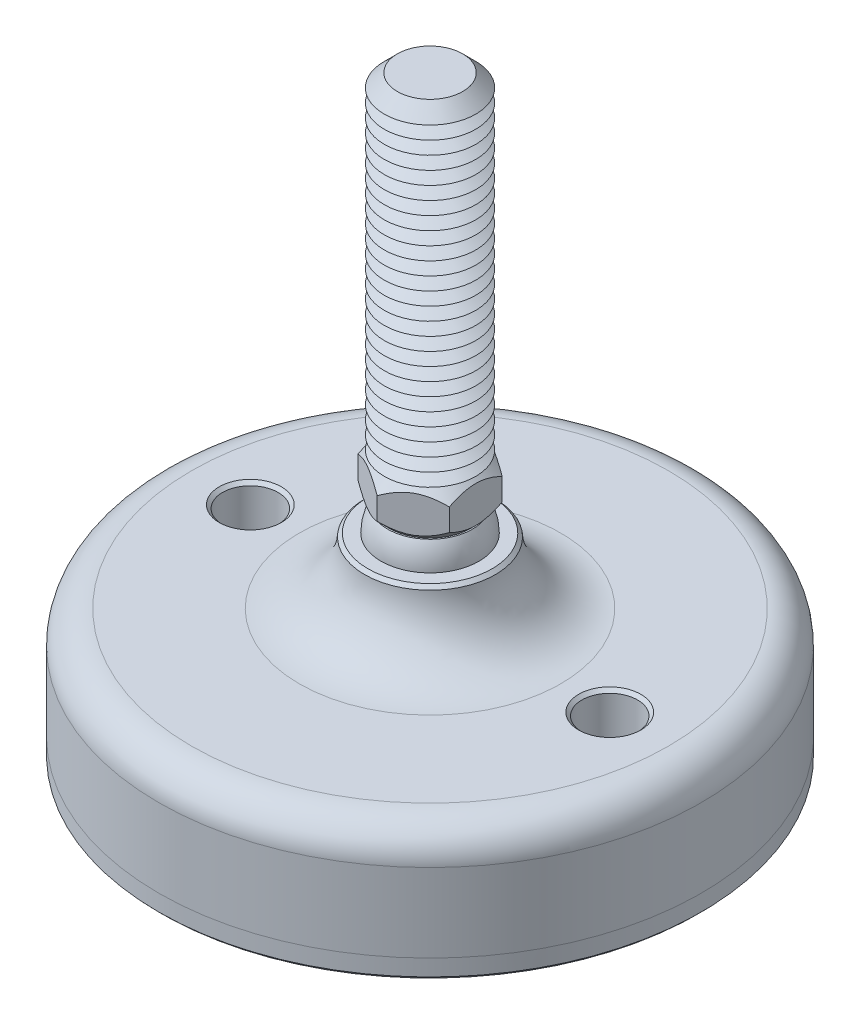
ISO-10303-21;
HEADER;
FILE_DESCRIPTION(('STEP AP214'),'2;1');
FILE_NAME('part.step','',(''),(''),'','','');
FILE_SCHEMA(('AUTOMOTIVE_DESIGN { 1 0 10303 214 1 1 1 1 }'));
ENDSEC;
DATA;
#1=APPLICATION_CONTEXT('core data for automotive mechanical design processes');
#2=APPLICATION_PROTOCOL_DEFINITION('international standard','automotive_design',2000,#1);
#3=PRODUCT_CONTEXT('',#1,'mechanical');
#4=PRODUCT('Part','Part','',(#3));
#5=PRODUCT_RELATED_PRODUCT_CATEGORY('part','',(#4));
#6=PRODUCT_DEFINITION_FORMATION('','',#4);
#7=PRODUCT_DEFINITION_CONTEXT('part definition',#1,'design');
#8=PRODUCT_DEFINITION('design','',#6,#7);
#9=PRODUCT_DEFINITION_SHAPE('','',#8);
#10=(LENGTH_UNIT() NAMED_UNIT(*) SI_UNIT(.MILLI.,.METRE.));
#11=(NAMED_UNIT(*) PLANE_ANGLE_UNIT() SI_UNIT($,.RADIAN.));
#12=(NAMED_UNIT(*) SI_UNIT($,.STERADIAN.) SOLID_ANGLE_UNIT());
#13=UNCERTAINTY_MEASURE_WITH_UNIT(LENGTH_MEASURE(1.E-05),#10,'distance_accuracy_value','');
#14=(GEOMETRIC_REPRESENTATION_CONTEXT(3) GLOBAL_UNCERTAINTY_ASSIGNED_CONTEXT((#13)) GLOBAL_UNIT_ASSIGNED_CONTEXT((#10,
#11,#12)) REPRESENTATION_CONTEXT('',''));
#15=CARTESIAN_POINT('',(0.,0.,0.));
#16=DIRECTION('',(0.,0.,1.));
#17=DIRECTION('',(1.,0.,0.));
#18=AXIS2_PLACEMENT_3D('',#15,#16,#17);
#19=CARTESIAN_POINT('',(0.,-27.,0.));
#20=DIRECTION('',(0.,1.,0.));
#21=DIRECTION('',(0.,0.,1.));
#22=AXIS2_PLACEMENT_3D('',#19,#20,#21);
#23=PLANE('',#22);
#24=CARTESIAN_POINT('',(-27.5,-27.,0.));
#25=DIRECTION('',(0.,1.,0.));
#26=DIRECTION('',(0.,0.,1.));
#27=AXIS2_PLACEMENT_3D('',#24,#25,#26);
#28=CIRCLE('',#27,4.25000000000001);
#29=CARTESIAN_POINT('',(-27.5,-27.,4.25000000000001));
#30=VERTEX_POINT('',#29);
#31=EDGE_CURVE('P0_E43',#30,#30,#28,.T.);
#32=ORIENTED_EDGE('',*,*,#31,.F.);
#33=EDGE_LOOP('',(#32));
#34=FACE_BOUND('',#33,.T.);
#35=CARTESIAN_POINT('',(27.5,-27.,0.));
#36=DIRECTION('',(0.,1.,0.));
#37=DIRECTION('',(0.,0.,1.));
#38=AXIS2_PLACEMENT_3D('',#35,#36,#37);
#39=CIRCLE('',#38,4.25000000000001);
#40=CARTESIAN_POINT('',(27.5,-27.,4.25000000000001));
#41=VERTEX_POINT('',#40);
#42=EDGE_CURVE('P0_E44',#41,#41,#39,.T.);
#43=ORIENTED_EDGE('',*,*,#42,.F.);
#44=EDGE_LOOP('',(#43));
#45=FACE_BOUND('',#44,.T.);
#46=CARTESIAN_POINT('',(0.,-27.,0.));
#47=DIRECTION('',(0.,1.,0.));
#48=DIRECTION('',(0.,0.,1.));
#49=AXIS2_PLACEMENT_3D('',#46,#47,#48);
#50=CIRCLE('',#49,41.5);
#51=CARTESIAN_POINT('',(0.,-27.,41.5));
#52=VERTEX_POINT('',#51);
#53=EDGE_CURVE('P0_E40',#52,#52,#50,.T.);
#54=ORIENTED_EDGE('',*,*,#53,.T.);
#55=EDGE_LOOP('',(#54));
#56=FACE_BOUND('',#55,.T.);
#57=ADVANCED_FACE('P0_F14',(#34,#45,#56),#23,.T.);
#58=CARTESIAN_POINT('',(0.,48.1654938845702,0.));
#59=DIRECTION('',(0.,1.,0.));
#60=DIRECTION('',(0.,0.,1.));
#61=AXIS2_PLACEMENT_3D('',#58,#59,#60);
#62=CYLINDRICAL_SURFACE('',#61,41.5);
#63=CARTESIAN_POINT('',(0.,-29.5,0.));
#64=DIRECTION('',(0.,-1.,0.));
#65=DIRECTION('',(0.,0.,-1.));
#66=AXIS2_PLACEMENT_3D('',#63,#64,#65);
#67=CIRCLE('',#66,41.5);
#68=CARTESIAN_POINT('',(0.,-29.5,-41.5));
#69=VERTEX_POINT('',#68);
#70=EDGE_CURVE('P0_E37',#69,#69,#67,.F.);
#71=ORIENTED_EDGE('',*,*,#70,.T.);
#72=EDGE_LOOP('',(#71));
#73=FACE_BOUND('',#72,.T.);
#74=ORIENTED_EDGE('',*,*,#53,.F.);
#75=EDGE_LOOP('',(#74));
#76=FACE_BOUND('',#75,.T.);
#77=ADVANCED_FACE('P0_F54',(#73,#76),#62,.T.);
#78=CARTESIAN_POINT('',(0.,-30.,41.5));
#79=DIRECTION('',(0.,-1.,0.));
#80=DIRECTION('',(0.,0.,-1.));
#81=AXIS2_PLACEMENT_3D('',#78,#79,#80);
#82=PLANE('',#81);
#83=CARTESIAN_POINT('',(27.5,-30.,0.));
#84=DIRECTION('',(0.,-1.,0.));
#85=DIRECTION('',(0.,0.,-1.));
#86=AXIS2_PLACEMENT_3D('',#83,#84,#85);
#87=CIRCLE('',#86,4.75);
#88=CARTESIAN_POINT('',(27.5,-30.,-4.75000000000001));
#89=VERTEX_POINT('',#88);
#90=EDGE_CURVE('P0_E25',#89,#89,#87,.F.);
#91=ORIENTED_EDGE('',*,*,#90,.T.);
#92=EDGE_LOOP('',(#91));
#93=FACE_BOUND('',#92,.T.);
#94=CARTESIAN_POINT('',(-27.5,-30.,0.));
#95=DIRECTION('',(0.,-1.,0.));
#96=DIRECTION('',(0.,0.,-1.));
#97=AXIS2_PLACEMENT_3D('',#94,#95,#96);
#98=CIRCLE('',#97,4.75);
#99=CARTESIAN_POINT('',(-27.5,-30.,-4.75));
#100=VERTEX_POINT('',#99);
#101=EDGE_CURVE('P0_E29',#100,#100,#98,.F.);
#102=ORIENTED_EDGE('',*,*,#101,.T.);
#103=EDGE_LOOP('',(#102));
#104=FACE_BOUND('',#103,.T.);
#105=CARTESIAN_POINT('',(0.,-30.,0.));
#106=DIRECTION('',(0.,-1.,0.));
#107=DIRECTION('',(0.,0.,-1.));
#108=AXIS2_PLACEMENT_3D('',#105,#106,#107);
#109=CIRCLE('',#108,41.);
#110=CARTESIAN_POINT('',(0.,-30.,-41.));
#111=VERTEX_POINT('',#110);
#112=EDGE_CURVE('P0_E34',#111,#111,#109,.T.);
#113=ORIENTED_EDGE('',*,*,#112,.T.);
#114=EDGE_LOOP('',(#113));
#115=FACE_BOUND('',#114,.T.);
#116=ADVANCED_FACE('P0_F61',(#93,#104,#115),#82,.T.);
#117=CARTESIAN_POINT('',(0.,-29.5,0.));
#118=DIRECTION('',(0.,1.,0.));
#119=DIRECTION('',(0.,0.,1.));
#120=AXIS2_PLACEMENT_3D('',#117,#118,#119);
#121=CONICAL_SURFACE('',#120,41.5,0.785398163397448);
#122=ORIENTED_EDGE('',*,*,#112,.F.);
#123=EDGE_LOOP('',(#122));
#124=FACE_BOUND('',#123,.T.);
#125=ORIENTED_EDGE('',*,*,#70,.F.);
#126=EDGE_LOOP('',(#125));
#127=FACE_BOUND('',#126,.T.);
#128=ADVANCED_FACE('P0_F68',(#124,#127),#121,.T.);
#129=CARTESIAN_POINT('',(27.5,-30.,0.));
#130=DIRECTION('',(0.,1.,0.));
#131=DIRECTION('',(0.,0.,1.));
#132=AXIS2_PLACEMENT_3D('',#129,#130,#131);
#133=CYLINDRICAL_SURFACE('',#132,4.25000000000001);
#134=CARTESIAN_POINT('',(27.5,-29.5,0.));
#135=DIRECTION('',(0.,-1.,0.));
#136=DIRECTION('',(0.,0.,-1.));
#137=AXIS2_PLACEMENT_3D('',#134,#135,#136);
#138=CIRCLE('',#137,4.25000000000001);
#139=CARTESIAN_POINT('',(27.5,-29.5,-4.25000000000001));
#140=VERTEX_POINT('',#139);
#141=EDGE_CURVE('P0_E21',#140,#140,#138,.T.);
#142=ORIENTED_EDGE('',*,*,#141,.T.);
#143=EDGE_LOOP('',(#142));
#144=FACE_BOUND('',#143,.T.);
#145=ORIENTED_EDGE('',*,*,#42,.T.);
#146=EDGE_LOOP('',(#145));
#147=FACE_BOUND('',#146,.T.);
#148=ADVANCED_FACE('P0_F74',(#144,#147),#133,.F.);
#149=CARTESIAN_POINT('',(-27.5,-30.,0.));
#150=DIRECTION('',(0.,1.,0.));
#151=DIRECTION('',(0.,0.,1.));
#152=AXIS2_PLACEMENT_3D('',#149,#150,#151);
#153=CYLINDRICAL_SURFACE('',#152,4.25000000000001);
#154=CARTESIAN_POINT('',(-27.5,-29.5,0.));
#155=DIRECTION('',(0.,-1.,0.));
#156=DIRECTION('',(0.,0.,-1.));
#157=AXIS2_PLACEMENT_3D('',#154,#155,#156);
#158=CIRCLE('',#157,4.25000000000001);
#159=CARTESIAN_POINT('',(-27.5,-29.5,-4.25000000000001));
#160=VERTEX_POINT('',#159);
#161=EDGE_CURVE('P0_E10',#160,#160,#158,.T.);
#162=ORIENTED_EDGE('',*,*,#161,.T.);
#163=EDGE_LOOP('',(#162));
#164=FACE_BOUND('',#163,.T.);
#165=ORIENTED_EDGE('',*,*,#31,.T.);
#166=EDGE_LOOP('',(#165));
#167=FACE_BOUND('',#166,.T.);
#168=ADVANCED_FACE('P0_F50',(#164,#167),#153,.F.);
#169=CARTESIAN_POINT('',(27.5,-30.,0.));
#170=DIRECTION('',(0.,-1.,0.));
#171=DIRECTION('',(0.,0.,-1.));
#172=AXIS2_PLACEMENT_3D('',#169,#170,#171);
#173=CONICAL_SURFACE('',#172,4.75,0.785398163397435);
#174=ORIENTED_EDGE('',*,*,#141,.F.);
#175=EDGE_LOOP('',(#174));
#176=FACE_BOUND('',#175,.T.);
#177=ORIENTED_EDGE('',*,*,#90,.F.);
#178=EDGE_LOOP('',(#177));
#179=FACE_BOUND('',#178,.T.);
#180=ADVANCED_FACE('P0_F76',(#176,#179),#173,.F.);
#181=CARTESIAN_POINT('',(-27.5,-30.,0.));
#182=DIRECTION('',(0.,-1.,0.));
#183=DIRECTION('',(0.,0.,-1.));
#184=AXIS2_PLACEMENT_3D('',#181,#182,#183);
#185=CONICAL_SURFACE('',#184,4.75,0.785398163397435);
#186=ORIENTED_EDGE('',*,*,#161,.F.);
#187=EDGE_LOOP('',(#186));
#188=FACE_BOUND('',#187,.T.);
#189=ORIENTED_EDGE('',*,*,#101,.F.);
#190=EDGE_LOOP('',(#189));
#191=FACE_BOUND('',#190,.T.);
#192=ADVANCED_FACE('P0_F16',(#188,#191),#185,.F.);
#193=CLOSED_SHELL('',(#57,#77,#116,#128,#148,#168,#180,#192));
#194=MANIFOLD_SOLID_BREP('P0_B1',#193);
#195=CARTESIAN_POINT('',(0.,0.,0.));
#196=DIRECTION('',(0.,1.,0.));
#197=DIRECTION('',(0.,0.,-1.));
#198=AXIS2_PLACEMENT_3D('',#195,#196,#197);
#199=SPHERICAL_SURFACE('',#198,7.5);
#200=CARTESIAN_POINT('',(0.,3.75,0.));
#201=DIRECTION('',(0.,-1.,0.));
#202=DIRECTION('',(0.,0.,-1.));
#203=AXIS2_PLACEMENT_3D('',#200,#201,#202);
#204=CIRCLE('',#203,6.49519052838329);
#205=CARTESIAN_POINT('',(0.,3.75,-6.49519052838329));
#206=VERTEX_POINT('',#205);
#207=EDGE_CURVE('P1_E207',#206,#206,#204,.F.);
#208=ORIENTED_EDGE('',*,*,#207,.F.);
#209=EDGE_LOOP('',(#208));
#210=FACE_BOUND('',#209,.T.);
#211=ADVANCED_FACE('P1_F16',(#210),#199,.T.);
#212=CARTESIAN_POINT('',(0.,3.75,0.));
#213=DIRECTION('',(0.,1.,0.));
#214=DIRECTION('',(0.,0.,1.));
#215=AXIS2_PLACEMENT_3D('',#212,#213,#214);
#216=CONICAL_SURFACE('',#215,6.26419292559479,0.785398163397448);
#217=CARTESIAN_POINT('',(0.,3.75,0.));
#218=DIRECTION('',(0.,1.,0.));
#219=DIRECTION('',(0.,0.,1.));
#220=AXIS2_PLACEMENT_3D('',#217,#218,#219);
#221=CIRCLE('',#220,6.26419292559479);
#222=CARTESIAN_POINT('',(0.,3.75,6.26419292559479));
#223=VERTEX_POINT('',#222);
#224=EDGE_CURVE('P1_E211',#223,#223,#221,.T.);
#225=ORIENTED_EDGE('',*,*,#224,.T.);
#226=EDGE_LOOP('',(#225));
#227=FACE_BOUND('',#226,.T.);
#228=CARTESIAN_POINT('',(-7.,8.22175145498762,-8.1400553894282));
#229=CARTESIAN_POINT('',(-7.,8.07177748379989,-7.94220937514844));
#230=CARTESIAN_POINT('',(-7.,7.92322959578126,-7.74326459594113));
#231=CARTESIAN_POINT('',(-7.,7.62962733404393,-7.34274065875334));
#232=CARTESIAN_POINT('',(-7.,7.48457383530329,-7.14116086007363));
#233=CARTESIAN_POINT('',(-7.,7.19756981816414,-6.73345531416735));
#234=CARTESIAN_POINT('',(-7.,7.05565202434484,-6.52730645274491));
#235=CARTESIAN_POINT('',(-7.,6.77703382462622,-6.11152362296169));
#236=CARTESIAN_POINT('',(-7.,6.64033305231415,-5.90188990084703));
#237=CARTESIAN_POINT('',(-7.,6.36550740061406,-5.46619755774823));
#238=CARTESIAN_POINT('',(-7.,6.22776674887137,-5.23989534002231));
#239=CARTESIAN_POINT('',(-7.,5.96123372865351,-4.78200028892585));
#240=CARTESIAN_POINT('',(-7.,5.83244279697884,-4.55040661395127));
#241=CARTESIAN_POINT('',(-7.,5.58658047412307,-4.08193183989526));
#242=CARTESIAN_POINT('',(-7.,5.46947462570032,-3.8450689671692));
#243=CARTESIAN_POINT('',(-7.,5.24960465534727,-3.36483104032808));
#244=CARTESIAN_POINT('',(-7.,5.14683397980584,-3.12145902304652));
#245=CARTESIAN_POINT('',(-7.,4.96723655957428,-2.64866791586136));
#246=CARTESIAN_POINT('',(-7.,4.88895097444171,-2.41980876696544));
#247=CARTESIAN_POINT('',(-7.,4.75072959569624,-1.9565107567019));
#248=CARTESIAN_POINT('',(-7.,4.69079504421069,-1.72207151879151));
#249=CARTESIAN_POINT('',(-7.,4.59342684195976,-1.25295119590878));
#250=CARTESIAN_POINT('',(-7.,4.5556027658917,-1.01835249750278));
#251=CARTESIAN_POINT('',(-7.,4.50320231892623,-0.546559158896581));
#252=CARTESIAN_POINT('',(-7.,4.48862178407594,-0.309364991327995));
#253=CARTESIAN_POINT('',(-7.,4.48382612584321,0.156313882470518));
#254=CARTESIAN_POINT('',(-7.,4.49271264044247,0.384789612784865));
#255=CARTESIAN_POINT('',(-7.,4.53235928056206,0.839822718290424));
#256=CARTESIAN_POINT('',(-7.,4.56312150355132,1.06637990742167));
#257=CARTESIAN_POINT('',(-7.,4.64535130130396,1.51976805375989));
#258=CARTESIAN_POINT('',(-7.,4.69717402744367,1.74653354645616));
#259=CARTESIAN_POINT('',(-7.,4.81873728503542,2.19511331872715));
#260=CARTESIAN_POINT('',(-7.,4.88847641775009,2.41692798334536));
#261=CARTESIAN_POINT('',(-7.,5.04951755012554,2.87389766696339));
#262=CARTESIAN_POINT('',(-7.,5.14215063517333,3.10857869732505));
#263=CARTESIAN_POINT('',(-7.,5.3416605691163,3.57185972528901));
#264=CARTESIAN_POINT('',(-7.,5.44854400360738,3.80045685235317));
#265=CARTESIAN_POINT('',(-7.,5.6740138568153,4.25267813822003));
#266=CARTESIAN_POINT('',(-7.,5.79263686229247,4.47628390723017));
#267=CARTESIAN_POINT('',(-7.,6.03896666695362,4.91835509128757));
#268=CARTESIAN_POINT('',(-7.,6.16667203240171,5.13682131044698));
#269=CARTESIAN_POINT('',(-7.,6.4228595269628,5.55855563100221));
#270=CARTESIAN_POINT('',(-7.,6.55098806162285,5.76203966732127));
#271=CARTESIAN_POINT('',(-7.,6.81264959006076,6.16551366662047));
#272=CARTESIAN_POINT('',(-7.,6.94618299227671,6.36550336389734));
#273=CARTESIAN_POINT('',(-7.,7.21658951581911,6.76082742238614));
#274=CARTESIAN_POINT('',(-7.,7.35342681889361,6.95618637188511));
#275=CARTESIAN_POINT('',(-7.,7.6307324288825,7.34423185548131));
#276=CARTESIAN_POINT('',(-7.,7.77119972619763,7.53691911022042));
#277=CARTESIAN_POINT('',(-7.,7.91315155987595,7.72848711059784));
#278=B_SPLINE_CURVE_WITH_KNOTS('',3,(#228,#229,#230,#231,#232,#233,#234,#235,#236,#237,#238,
#239,#240,#241,#242,#243,#244,#245,#246,#247,#248,#249,#250,#251,#252,#253,#254,#255,#256,#257,
#258,#259,#260,#261,#262,#263,#264,#265,#266,#267,#268,#269,#270,#271,#272,#273,#274,#275,#276,
#277),.UNSPECIFIED.,.F.,.F.,(4,2,2,2,2,2,2,2,2,2,2,2,2,2,2,2,2,2,2,2,2,2,2,2,4),(0.,
0.744807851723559,1.48980030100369,2.2405614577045,2.99126978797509,3.78587980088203,
4.58061708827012,5.37293691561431,6.16489332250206,6.88989369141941,7.61494312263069,
8.32676947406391,9.0384682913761,9.72332048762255,10.4082383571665,11.1052200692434,
11.8021473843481,12.5584650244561,13.3151334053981,14.0742390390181,14.8332251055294,
15.5545151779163,16.2758598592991,16.9913609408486,17.7066651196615),.UNSPECIFIED.);
#279=CARTESIAN_POINT('',(-7.,5.56871084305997,-4.04145188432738));
#280=VERTEX_POINT('',#279);
#281=CARTESIAN_POINT('',(-7.,5.56871084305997,4.04145188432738));
#282=VERTEX_POINT('',#281);
#283=EDGE_CURVE('P1_E24',#280,#282,#278,.T.);
#284=ORIENTED_EDGE('',*,*,#283,.F.);
#285=CARTESIAN_POINT('',(0.000199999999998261,5.56882631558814,-8.0830192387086));
#286=CARTESIAN_POINT('',(-0.120159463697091,5.49934419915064,-8.01352966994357));
#287=CARTESIAN_POINT('',(-0.241444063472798,5.43199440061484,-7.94350597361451));
#288=CARTESIAN_POINT('',(-0.486045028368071,5.30220807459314,-7.80228554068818));
#289=CARTESIAN_POINT('',(-0.60936245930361,5.2397742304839,-7.73108818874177));
#290=CARTESIAN_POINT('',(-0.983781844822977,5.06028719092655,-7.51491705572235));
#291=CARTESIAN_POINT('',(-1.23805341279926,4.95181416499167,-7.36811329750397));
#292=CARTESIAN_POINT('',(-1.75081233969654,4.76606165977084,-7.07207179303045));
#293=CARTESIAN_POINT('',(-2.00916864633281,4.68831421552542,-6.92290970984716));
#294=CARTESIAN_POINT('',(-2.40095049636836,4.59837958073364,-6.69671435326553));
#295=CARTESIAN_POINT('',(-2.53212124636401,4.57286115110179,-6.62098288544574));
#296=CARTESIAN_POINT('',(-2.79557335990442,4.53129725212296,-6.4688787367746));
#297=CARTESIAN_POINT('',(-2.92785455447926,4.5152503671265,-6.39250615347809));
#298=CARTESIAN_POINT('',(-3.25020698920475,4.48834537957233,-6.2063958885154));
#299=CARTESIAN_POINT('',(-3.44062555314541,4.48270029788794,-6.09645767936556));
#300=CARTESIAN_POINT('',(-3.82111946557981,4.49217587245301,-5.87677941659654));
#301=CARTESIAN_POINT('',(-4.01119467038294,4.5073038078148,-5.76703944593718));
#302=CARTESIAN_POINT('',(-4.38955306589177,4.55743368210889,-5.54859412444));
#303=CARTESIAN_POINT('',(-4.57783401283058,4.5924578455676,-5.43989006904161));
#304=CARTESIAN_POINT('',(-4.95115981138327,4.68047604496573,-5.22435031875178));
#305=CARTESIAN_POINT('',(-5.13620490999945,4.73346870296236,-5.1175144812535));
#306=CARTESIAN_POINT('',(-5.46469033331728,4.84248989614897,-4.92786333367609));
#307=CARTESIAN_POINT('',(-5.6088580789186,4.89565100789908,-4.8446280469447));
#308=CARTESIAN_POINT('',(-5.8946056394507,5.0105398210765,-4.67965161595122));
#309=CARTESIAN_POINT('',(-6.03618537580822,5.07226778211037,-4.5979105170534));
#310=CARTESIAN_POINT('',(-6.31631098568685,5.20290661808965,-4.43617992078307));
#311=CARTESIAN_POINT('',(-6.4548648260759,5.27179490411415,-4.3561858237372));
#312=CARTESIAN_POINT('',(-6.72940692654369,5.41585000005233,-4.19767886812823));
#313=CARTESIAN_POINT('',(-6.86539669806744,5.49101295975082,-4.11916513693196));
#314=CARTESIAN_POINT('',(-7.0002,5.56882631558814,-4.04133641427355));
#315=B_SPLINE_CURVE_WITH_KNOTS('',3,(#285,#286,#287,#288,#289,#290,#291,#292,#293,#294,#295,
#296,#297,#298,#299,#300,#301,#302,#303,#304,#305,#306,#307,#308,#309,#310,#311,#312,#313,#314),
.UNSPECIFIED.,.F.,.F.,(4,2,2,2,2,2,2,2,2,2,2,2,2,2,4),(0.,0.466112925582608,0.932478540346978,
1.87024464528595,2.79312018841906,3.25365289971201,3.71411676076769,4.37293813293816,
5.03199042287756,5.69178034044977,6.35151967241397,6.8755322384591,7.39956068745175,
7.92198344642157,8.44408796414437),.UNSPECIFIED.);
#316=CARTESIAN_POINT('',(0.,5.56871084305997,-8.08290376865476));
#317=VERTEX_POINT('',#316);
#318=EDGE_CURVE('P1_E112',#317,#280,#315,.T.);
#319=ORIENTED_EDGE('',*,*,#318,.F.);
#320=CARTESIAN_POINT('',(7.00019999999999,5.56882631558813,-4.04133641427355));
#321=CARTESIAN_POINT('',(6.8798405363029,5.49934419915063,-4.11082598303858));
#322=CARTESIAN_POINT('',(6.7585559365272,5.43199440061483,-4.18084967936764));
#323=CARTESIAN_POINT('',(6.51395497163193,5.30220807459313,-4.32207011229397));
#324=CARTESIAN_POINT('',(6.39063754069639,5.2397742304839,-4.39326746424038));
#325=CARTESIAN_POINT('',(6.01621815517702,5.06028719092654,-4.6094385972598));
#326=CARTESIAN_POINT('',(5.76194658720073,4.95181416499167,-4.75624235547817));
#327=CARTESIAN_POINT('',(5.24918766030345,4.76606165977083,-5.0522838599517));
#328=CARTESIAN_POINT('',(4.99083135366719,4.68831421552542,-5.20144594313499));
#329=CARTESIAN_POINT('',(4.59904950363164,4.59837958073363,-5.42764129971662));
#330=CARTESIAN_POINT('',(4.46787875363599,4.57286115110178,-5.50337276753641));
#331=CARTESIAN_POINT('',(4.20442664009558,4.53129725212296,-5.65547691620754));
#332=CARTESIAN_POINT('',(4.07214544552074,4.5152503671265,-5.73184949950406));
#333=CARTESIAN_POINT('',(3.74979301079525,4.48834537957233,-5.91795976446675));
#334=CARTESIAN_POINT('',(3.55937444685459,4.48270029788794,-6.02789797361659));
#335=CARTESIAN_POINT('',(3.17888053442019,4.49217587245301,-6.2475762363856));
#336=CARTESIAN_POINT('',(2.98880532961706,4.5073038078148,-6.35731620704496));
#337=CARTESIAN_POINT('',(2.61044693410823,4.55743368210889,-6.57576152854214));
#338=CARTESIAN_POINT('',(2.42216598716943,4.5924578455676,-6.68446558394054));
#339=CARTESIAN_POINT('',(2.04884018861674,4.68047604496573,-6.90000533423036));
#340=CARTESIAN_POINT('',(1.86379509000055,4.73346870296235,-7.00684117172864));
#341=CARTESIAN_POINT('',(1.53530966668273,4.84248989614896,-7.19649231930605));
#342=CARTESIAN_POINT('',(1.3911419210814,4.89565100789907,-7.27972760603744));
#343=CARTESIAN_POINT('',(1.1053943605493,5.0105398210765,-7.44470403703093));
#344=CARTESIAN_POINT('',(0.96381462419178,5.07226778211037,-7.52644513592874));
#345=CARTESIAN_POINT('',(0.683689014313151,5.20290661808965,-7.68817573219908));
#346=CARTESIAN_POINT('',(0.545135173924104,5.27179490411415,-7.76816982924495));
#347=CARTESIAN_POINT('',(0.270593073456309,5.41585000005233,-7.92667678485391));
#348=CARTESIAN_POINT('',(0.134603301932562,5.49101295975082,-8.00519051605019));
#349=CARTESIAN_POINT('',(-0.00020000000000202,5.56882631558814,-8.0830192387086));
#350=B_SPLINE_CURVE_WITH_KNOTS('',3,(#320,#321,#322,#323,#324,#325,#326,#327,#328,#329,#330,
#331,#332,#333,#334,#335,#336,#337,#338,#339,#340,#341,#342,#343,#344,#345,#346,#347,#348,#349),
.UNSPECIFIED.,.F.,.F.,(4,2,2,2,2,2,2,2,2,2,2,2,2,2,4),(0.,0.466112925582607,0.932478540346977,
1.87024464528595,2.79312018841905,3.25365289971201,3.71411676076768,4.37293813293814,
5.03199042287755,5.69178034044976,6.35151967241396,6.87553223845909,7.39956068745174,
7.92198344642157,8.44408796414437),.UNSPECIFIED.);
#351=CARTESIAN_POINT('',(7.,5.56871084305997,-4.04145188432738));
#352=VERTEX_POINT('',#351);
#353=EDGE_CURVE('P1_E119',#352,#317,#350,.T.);
#354=ORIENTED_EDGE('',*,*,#353,.F.);
#355=CARTESIAN_POINT('',(6.99999999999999,8.22175145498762,-8.1400553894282));
#356=CARTESIAN_POINT('',(6.99999999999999,8.07177748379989,-7.94220937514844));
#357=CARTESIAN_POINT('',(6.99999999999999,7.92322959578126,-7.74326459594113));
#358=CARTESIAN_POINT('',(6.99999999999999,7.62962733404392,-7.34274065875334));
#359=CARTESIAN_POINT('',(6.99999999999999,7.48457383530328,-7.14116086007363));
#360=CARTESIAN_POINT('',(6.99999999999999,7.19756981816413,-6.73345531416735));
#361=CARTESIAN_POINT('',(6.99999999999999,7.05565202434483,-6.52730645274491));
#362=CARTESIAN_POINT('',(6.99999999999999,6.77703382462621,-6.11152362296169));
#363=CARTESIAN_POINT('',(6.99999999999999,6.64033305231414,-5.90188990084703));
#364=CARTESIAN_POINT('',(6.99999999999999,6.36550740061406,-5.46619755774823));
#365=CARTESIAN_POINT('',(6.99999999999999,6.22776674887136,-5.23989534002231));
#366=CARTESIAN_POINT('',(6.99999999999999,5.9612337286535,-4.78200028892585));
#367=CARTESIAN_POINT('',(6.99999999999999,5.83244279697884,-4.55040661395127));
#368=CARTESIAN_POINT('',(6.99999999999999,5.58658047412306,-4.08193183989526));
#369=CARTESIAN_POINT('',(6.99999999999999,5.46947462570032,-3.8450689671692));
#370=CARTESIAN_POINT('',(6.99999999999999,5.24960465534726,-3.36483104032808));
#371=CARTESIAN_POINT('',(6.99999999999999,5.14683397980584,-3.12145902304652));
#372=CARTESIAN_POINT('',(6.99999999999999,4.96723655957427,-2.64866791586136));
#373=CARTESIAN_POINT('',(6.99999999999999,4.88895097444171,-2.41980876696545));
#374=CARTESIAN_POINT('',(6.99999999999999,4.75072959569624,-1.9565107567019));
#375=CARTESIAN_POINT('',(6.99999999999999,4.69079504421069,-1.72207151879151));
#376=CARTESIAN_POINT('',(6.99999999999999,4.59342684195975,-1.25295119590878));
#377=CARTESIAN_POINT('',(6.99999999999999,4.5556027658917,-1.01835249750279));
#378=CARTESIAN_POINT('',(6.99999999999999,4.50320231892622,-0.546559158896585));
#379=CARTESIAN_POINT('',(6.99999999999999,4.48862178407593,-0.309364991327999));
#380=CARTESIAN_POINT('',(6.99999999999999,4.48382612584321,0.156313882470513));
#381=CARTESIAN_POINT('',(6.99999999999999,4.49271264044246,0.38478961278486));
#382=CARTESIAN_POINT('',(6.99999999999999,4.53235928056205,0.83982271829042));
#383=CARTESIAN_POINT('',(6.99999999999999,4.56312150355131,1.06637990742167));
#384=CARTESIAN_POINT('',(6.99999999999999,4.64535130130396,1.51976805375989));
#385=CARTESIAN_POINT('',(6.99999999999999,4.69717402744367,1.74653354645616));
#386=CARTESIAN_POINT('',(6.99999999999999,4.81873728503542,2.19511331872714));
#387=CARTESIAN_POINT('',(7.,4.88847641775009,2.41692798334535));
#388=CARTESIAN_POINT('',(7.,5.04951755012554,2.87389766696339));
#389=CARTESIAN_POINT('',(7.,5.14215063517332,3.10857869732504));
#390=CARTESIAN_POINT('',(7.,5.34166056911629,3.571859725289));
#391=CARTESIAN_POINT('',(7.,5.44854400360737,3.80045685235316));
#392=CARTESIAN_POINT('',(7.,5.67401385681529,4.25267813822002));
#393=CARTESIAN_POINT('',(7.,5.79263686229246,4.47628390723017));
#394=CARTESIAN_POINT('',(7.,6.03896666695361,4.91835509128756));
#395=CARTESIAN_POINT('',(7.,6.1666720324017,5.13682131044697));
#396=CARTESIAN_POINT('',(7.,6.42285952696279,5.5585556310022));
#397=CARTESIAN_POINT('',(7.,6.55098806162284,5.76203966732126));
#398=CARTESIAN_POINT('',(7.,6.81264959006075,6.16551366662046));
#399=CARTESIAN_POINT('',(7.,6.9461829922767,6.36550336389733));
#400=CARTESIAN_POINT('',(7.,7.21658951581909,6.76082742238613));
#401=CARTESIAN_POINT('',(7.,7.3534268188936,6.9561863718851));
#402=CARTESIAN_POINT('',(7.,7.63073242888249,7.3442318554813));
#403=CARTESIAN_POINT('',(7.,7.77119972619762,7.53691911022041));
#404=CARTESIAN_POINT('',(7.,7.91315155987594,7.72848711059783));
#405=B_SPLINE_CURVE_WITH_KNOTS('',3,(#355,#356,#357,#358,#359,#360,#361,#362,#363,#364,#365,
#366,#367,#368,#369,#370,#371,#372,#373,#374,#375,#376,#377,#378,#379,#380,#381,#382,#383,#384,
#385,#386,#387,#388,#389,#390,#391,#392,#393,#394,#395,#396,#397,#398,#399,#400,#401,#402,#403,
#404),.UNSPECIFIED.,.F.,.F.,(4,2,2,2,2,2,2,2,2,2,2,2,2,2,2,2,2,2,2,2,2,2,2,2,4),(0.,
0.744807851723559,1.48980030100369,2.2405614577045,2.9912697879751,3.78587980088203,
4.58061708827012,5.3729369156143,6.16489332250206,6.8898936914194,7.61494312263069,
8.32676947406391,9.03846829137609,9.72332048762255,10.4082383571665,11.1052200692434,
11.8021473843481,12.5584650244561,13.3151334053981,14.0742390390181,14.8332251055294,
15.5545151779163,16.275859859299,16.9913609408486,17.7066651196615),.UNSPECIFIED.);
#406=CARTESIAN_POINT('',(6.99999999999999,5.56871084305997,4.04145188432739));
#407=VERTEX_POINT('',#406);
#408=EDGE_CURVE('P1_E70',#407,#352,#405,.F.);
#409=ORIENTED_EDGE('',*,*,#408,.F.);
#410=CARTESIAN_POINT('',(-0.000200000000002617,5.56882631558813,8.0830192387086));
#411=CARTESIAN_POINT('',(0.120159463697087,5.49934419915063,8.01352966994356));
#412=CARTESIAN_POINT('',(0.241444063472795,5.43199440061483,7.9435059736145));
#413=CARTESIAN_POINT('',(0.486045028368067,5.30220807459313,7.80228554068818));
#414=CARTESIAN_POINT('',(0.609362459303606,5.2397742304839,7.73108818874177));
#415=CARTESIAN_POINT('',(0.983781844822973,5.06028719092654,7.51491705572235));
#416=CARTESIAN_POINT('',(1.23805341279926,4.95181416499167,7.36811329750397));
#417=CARTESIAN_POINT('',(1.75081233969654,4.76606165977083,7.07207179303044));
#418=CARTESIAN_POINT('',(2.00916864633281,4.68831421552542,6.92290970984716));
#419=CARTESIAN_POINT('',(2.40095049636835,4.59837958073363,6.69671435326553));
#420=CARTESIAN_POINT('',(2.53212124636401,4.57286115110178,6.62098288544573));
#421=CARTESIAN_POINT('',(2.79557335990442,4.53129725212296,6.4688787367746));
#422=CARTESIAN_POINT('',(2.92785455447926,4.5152503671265,6.39250615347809));
#423=CARTESIAN_POINT('',(3.25020698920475,4.48834537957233,6.2063958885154));
#424=CARTESIAN_POINT('',(3.44062555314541,4.48270029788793,6.09645767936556));
#425=CARTESIAN_POINT('',(3.82111946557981,4.492175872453,5.87677941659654));
#426=CARTESIAN_POINT('',(4.01119467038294,4.5073038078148,5.76703944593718));
#427=CARTESIAN_POINT('',(4.38955306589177,4.55743368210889,5.54859412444));
#428=CARTESIAN_POINT('',(4.57783401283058,4.5924578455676,5.4398900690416));
#429=CARTESIAN_POINT('',(4.95115981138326,4.68047604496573,5.22435031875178));
#430=CARTESIAN_POINT('',(5.13620490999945,4.73346870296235,5.1175144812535));
#431=CARTESIAN_POINT('',(5.46469033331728,4.84248989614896,4.92786333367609));
#432=CARTESIAN_POINT('',(5.6088580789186,4.89565100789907,4.8446280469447));
#433=CARTESIAN_POINT('',(5.8946056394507,5.01053982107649,4.67965161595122));
#434=CARTESIAN_POINT('',(6.03618537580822,5.07226778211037,4.5979105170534));
#435=CARTESIAN_POINT('',(6.31631098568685,5.20290661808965,4.43617992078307));
#436=CARTESIAN_POINT('',(6.45486482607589,5.27179490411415,4.3561858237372));
#437=CARTESIAN_POINT('',(6.72940692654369,5.41585000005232,4.19767886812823));
#438=CARTESIAN_POINT('',(6.86539669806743,5.49101295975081,4.11916513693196));
#439=CARTESIAN_POINT('',(7.00019999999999,5.56882631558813,4.04133641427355));
#440=B_SPLINE_CURVE_WITH_KNOTS('',3,(#410,#411,#412,#413,#414,#415,#416,#417,#418,#419,#420,
#421,#422,#423,#424,#425,#426,#427,#428,#429,#430,#431,#432,#433,#434,#435,#436,#437,#438,#439),
.UNSPECIFIED.,.F.,.F.,(4,2,2,2,2,2,2,2,2,2,2,2,2,2,4),(0.,0.466112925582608,0.932478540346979,
1.87024464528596,2.79312018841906,3.25365289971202,3.71411676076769,4.37293813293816,
5.03199042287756,5.69178034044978,6.35151967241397,6.8755322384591,7.39956068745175,
7.92198344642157,8.44408796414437),.UNSPECIFIED.);
#441=CARTESIAN_POINT('',(0.,5.56871084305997,8.08290376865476));
#442=VERTEX_POINT('',#441);
#443=EDGE_CURVE('P1_E67',#442,#407,#440,.T.);
#444=ORIENTED_EDGE('',*,*,#443,.F.);
#445=CARTESIAN_POINT('',(-7.0002,5.56882631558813,4.04133641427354));
#446=CARTESIAN_POINT('',(-6.87984053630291,5.49934419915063,4.11082598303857));
#447=CARTESIAN_POINT('',(-6.7585559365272,5.43199440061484,4.18084967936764));
#448=CARTESIAN_POINT('',(-6.51395497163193,5.30220807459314,4.32207011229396));
#449=CARTESIAN_POINT('',(-6.39063754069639,5.2397742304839,4.39326746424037));
#450=CARTESIAN_POINT('',(-6.01621815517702,5.06028719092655,4.60943859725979));
#451=CARTESIAN_POINT('',(-5.76194658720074,4.95181416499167,4.75624235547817));
#452=CARTESIAN_POINT('',(-5.24918766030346,4.76606165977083,5.0522838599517));
#453=CARTESIAN_POINT('',(-4.99083135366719,4.68831421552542,5.20144594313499));
#454=CARTESIAN_POINT('',(-4.59904950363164,4.59837958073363,5.42764129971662));
#455=CARTESIAN_POINT('',(-4.46787875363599,4.57286115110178,5.50337276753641));
#456=CARTESIAN_POINT('',(-4.20442664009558,4.53129725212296,5.65547691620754));
#457=CARTESIAN_POINT('',(-4.07214544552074,4.5152503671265,5.73184949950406));
#458=CARTESIAN_POINT('',(-3.74979301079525,4.48834537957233,5.91795976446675));
#459=CARTESIAN_POINT('',(-3.55937444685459,4.48270029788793,6.02789797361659));
#460=CARTESIAN_POINT('',(-3.17888053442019,4.492175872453,6.2475762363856));
#461=CARTESIAN_POINT('',(-2.98880532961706,4.5073038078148,6.35731620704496));
#462=CARTESIAN_POINT('',(-2.61044693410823,4.55743368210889,6.57576152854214));
#463=CARTESIAN_POINT('',(-2.42216598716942,4.5924578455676,6.68446558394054));
#464=CARTESIAN_POINT('',(-2.04884018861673,4.68047604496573,6.90000533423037));
#465=CARTESIAN_POINT('',(-1.86379509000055,4.73346870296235,7.00684117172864));
#466=CARTESIAN_POINT('',(-1.53530966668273,4.84248989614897,7.19649231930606));
#467=CARTESIAN_POINT('',(-1.3911419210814,4.89565100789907,7.27972760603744));
#468=CARTESIAN_POINT('',(-1.1053943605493,5.01053982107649,7.44470403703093));
#469=CARTESIAN_POINT('',(-0.963814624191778,5.07226778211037,7.52644513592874));
#470=CARTESIAN_POINT('',(-0.683689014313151,5.20290661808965,7.68817573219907));
#471=CARTESIAN_POINT('',(-0.545135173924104,5.27179490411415,7.76816982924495));
#472=CARTESIAN_POINT('',(-0.270593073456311,5.41585000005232,7.92667678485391));
#473=CARTESIAN_POINT('',(-0.134603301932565,5.49101295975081,8.00519051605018));
#474=CARTESIAN_POINT('',(0.000199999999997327,5.56882631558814,8.0830192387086));
#475=B_SPLINE_CURVE_WITH_KNOTS('',3,(#445,#446,#447,#448,#449,#450,#451,#452,#453,#454,#455,
#456,#457,#458,#459,#460,#461,#462,#463,#464,#465,#466,#467,#468,#469,#470,#471,#472,#473,#474),
.UNSPECIFIED.,.F.,.F.,(4,2,2,2,2,2,2,2,2,2,2,2,2,2,4),(0.,0.466112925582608,0.93247854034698,
1.87024464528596,2.79312018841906,3.25365289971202,3.71411676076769,4.37293813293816,
5.03199042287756,5.69178034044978,6.35151967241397,6.8755322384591,7.39956068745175,
7.92198344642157,8.44408796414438),.UNSPECIFIED.);
#476=EDGE_CURVE('P1_E39',#282,#442,#475,.T.);
#477=ORIENTED_EDGE('',*,*,#476,.F.);
#478=EDGE_LOOP('',(#284,#319,#354,#409,#444,#477));
#479=FACE_BOUND('',#478,.T.);
#480=ADVANCED_FACE('P1_F68',(#227,#479),#216,.T.);
#481=CARTESIAN_POINT('',(0.,3.75,6.26419292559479));
#482=DIRECTION('',(0.,-1.,0.));
#483=DIRECTION('',(0.,0.,-1.));
#484=AXIS2_PLACEMENT_3D('',#481,#482,#483);
#485=PLANE('',#484);
#486=ORIENTED_EDGE('',*,*,#207,.T.);
#487=EDGE_LOOP('',(#486));
#488=FACE_BOUND('',#487,.T.);
#489=ORIENTED_EDGE('',*,*,#224,.F.);
#490=EDGE_LOOP('',(#489));
#491=FACE_BOUND('',#490,.T.);
#492=ADVANCED_FACE('P1_F104',(#488,#491),#485,.F.);
#493=CARTESIAN_POINT('',(-7.,11.,4.04145188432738));
#494=DIRECTION('',(0.5,0.,-0.866025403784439));
#495=DIRECTION('',(-0.866025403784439,0.,-0.5));
#496=AXIS2_PLACEMENT_3D('',#493,#494,#495);
#497=PLANE('',#496);
#498=DIRECTION('',(0.,-1.,0.));
#499=VECTOR('',#498,1.);
#500=CARTESIAN_POINT('',(0.,11.,8.08290376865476));
#501=LINE('',#500,#499);
#502=CARTESIAN_POINT('',(0.,8.97927405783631,8.08290376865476));
#503=VERTEX_POINT('',#502);
#504=EDGE_CURVE('P1_E81',#503,#442,#501,.T.);
#505=ORIENTED_EDGE('',*,*,#504,.F.);
#506=CARTESIAN_POINT('',(0.000199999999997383,8.97915858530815,8.0830192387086));
#507=CARTESIAN_POINT('',(-0.120159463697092,9.04864070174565,8.01352966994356));
#508=CARTESIAN_POINT('',(-0.241444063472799,9.11599050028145,7.9435059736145));
#509=CARTESIAN_POINT('',(-0.486045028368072,9.24577682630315,7.80228554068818));
#510=CARTESIAN_POINT('',(-0.609362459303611,9.30821067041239,7.73108818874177));
#511=CARTESIAN_POINT('',(-0.983781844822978,9.48769770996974,7.51491705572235));
#512=CARTESIAN_POINT('',(-1.23805341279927,9.59617073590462,7.36811329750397));
#513=CARTESIAN_POINT('',(-1.75081233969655,9.78192324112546,7.07207179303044));
#514=CARTESIAN_POINT('',(-2.00916864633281,9.85967068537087,6.92290970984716));
#515=CARTESIAN_POINT('',(-2.40095049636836,9.94960532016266,6.69671435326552));
#516=CARTESIAN_POINT('',(-2.53212124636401,9.9751237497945,6.62098288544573));
#517=CARTESIAN_POINT('',(-2.79557335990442,10.0166876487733,6.4688787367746));
#518=CARTESIAN_POINT('',(-2.92785455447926,10.0327345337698,6.39250615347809));
#519=CARTESIAN_POINT('',(-3.25020698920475,10.059639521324,6.2063958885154));
#520=CARTESIAN_POINT('',(-3.44062555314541,10.0652846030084,6.09645767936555));
#521=CARTESIAN_POINT('',(-3.82111946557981,10.0558090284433,5.87677941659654));
#522=CARTESIAN_POINT('',(-4.01119467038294,10.0406810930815,5.76703944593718));
#523=CARTESIAN_POINT('',(-4.38955306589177,9.9905512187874,5.54859412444));
#524=CARTESIAN_POINT('',(-4.57783401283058,9.95552705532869,5.4398900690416));
#525=CARTESIAN_POINT('',(-4.95115981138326,9.86750885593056,5.22435031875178));
#526=CARTESIAN_POINT('',(-5.13620490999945,9.81451619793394,5.1175144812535));
#527=CARTESIAN_POINT('',(-5.46469033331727,9.70549500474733,4.92786333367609));
#528=CARTESIAN_POINT('',(-5.6088580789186,9.65233389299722,4.8446280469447));
#529=CARTESIAN_POINT('',(-5.8946056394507,9.5374450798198,4.67965161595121));
#530=CARTESIAN_POINT('',(-6.03618537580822,9.47571711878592,4.5979105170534));
#531=CARTESIAN_POINT('',(-6.31631098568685,9.34507828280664,4.43617992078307));
#532=CARTESIAN_POINT('',(-6.4548648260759,9.27618999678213,4.35618582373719));
#533=CARTESIAN_POINT('',(-6.72940692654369,9.13213490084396,4.19767886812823));
#534=CARTESIAN_POINT('',(-6.86539669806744,9.05697194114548,4.11916513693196));
#535=CARTESIAN_POINT('',(-7.0002,8.97915858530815,4.04133641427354));
#536=B_SPLINE_CURVE_WITH_KNOTS('',3,(#506,#507,#508,#509,#510,#511,#512,#513,#514,#515,#516,
#517,#518,#519,#520,#521,#522,#523,#524,#525,#526,#527,#528,#529,#530,#531,#532,#533,#534,#535),
.UNSPECIFIED.,.F.,.F.,(4,2,2,2,2,2,2,2,2,2,2,2,2,2,4),(0.,0.466112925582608,0.932478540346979,
1.87024464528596,2.79312018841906,3.25365289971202,3.71411676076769,4.37293813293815,
5.03199042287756,5.69178034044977,6.35151967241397,6.87553223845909,7.39956068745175,
7.92198344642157,8.44408796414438),.UNSPECIFIED.);
#537=CARTESIAN_POINT('',(-7.,8.97927405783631,4.04145188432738));
#538=VERTEX_POINT('',#537);
#539=EDGE_CURVE('P1_E149',#503,#538,#536,.T.);
#540=ORIENTED_EDGE('',*,*,#539,.T.);
#541=DIRECTION('',(0.,-1.,0.));
#542=VECTOR('',#541,1.);
#543=CARTESIAN_POINT('',(-7.,11.,4.04145188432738));
#544=LINE('',#543,#542);
#545=EDGE_CURVE('P1_E83',#538,#282,#544,.T.);
#546=ORIENTED_EDGE('',*,*,#545,.T.);
#547=ORIENTED_EDGE('',*,*,#476,.T.);
#548=EDGE_LOOP('',(#505,#540,#546,#547));
#549=FACE_BOUND('',#548,.T.);
#550=ADVANCED_FACE('P1_F79',(#549),#497,.F.);
#551=CARTESIAN_POINT('',(0.,11.,8.08290376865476));
#552=DIRECTION('',(-0.5,0.,-0.866025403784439));
#553=DIRECTION('',(-0.866025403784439,0.,0.5));
#554=AXIS2_PLACEMENT_3D('',#551,#552,#553);
#555=PLANE('',#554);
#556=DIRECTION('',(0.,-1.,0.));
#557=VECTOR('',#556,1.);
#558=CARTESIAN_POINT('',(7.,11.,4.04145188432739));
#559=LINE('',#558,#557);
#560=CARTESIAN_POINT('',(7.,8.97927405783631,4.04145188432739));
#561=VERTEX_POINT('',#560);
#562=EDGE_CURVE('P1_E88',#561,#407,#559,.T.);
#563=ORIENTED_EDGE('',*,*,#562,.F.);
#564=CARTESIAN_POINT('',(7.0002,8.97915858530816,4.04133641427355));
#565=CARTESIAN_POINT('',(6.87984053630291,9.04864070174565,4.11082598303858));
#566=CARTESIAN_POINT('',(6.7585559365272,9.11599050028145,4.18084967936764));
#567=CARTESIAN_POINT('',(6.51395497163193,9.24577682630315,4.32207011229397));
#568=CARTESIAN_POINT('',(6.39063754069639,9.30821067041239,4.39326746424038));
#569=CARTESIAN_POINT('',(6.01621815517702,9.48769770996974,4.6094385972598));
#570=CARTESIAN_POINT('',(5.76194658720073,9.59617073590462,4.75624235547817));
#571=CARTESIAN_POINT('',(5.24918766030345,9.78192324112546,5.0522838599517));
#572=CARTESIAN_POINT('',(4.99083135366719,9.85967068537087,5.20144594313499));
#573=CARTESIAN_POINT('',(4.59904950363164,9.94960532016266,5.42764129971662));
#574=CARTESIAN_POINT('',(4.46787875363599,9.9751237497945,5.50337276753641));
#575=CARTESIAN_POINT('',(4.20442664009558,10.0166876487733,5.65547691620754));
#576=CARTESIAN_POINT('',(4.07214544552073,10.0327345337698,5.73184949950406));
#577=CARTESIAN_POINT('',(3.74979301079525,10.059639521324,5.91795976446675));
#578=CARTESIAN_POINT('',(3.55937444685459,10.0652846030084,6.02789797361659));
#579=CARTESIAN_POINT('',(3.17888053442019,10.0558090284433,6.2475762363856));
#580=CARTESIAN_POINT('',(2.98880532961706,10.0406810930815,6.35731620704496));
#581=CARTESIAN_POINT('',(2.61044693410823,9.9905512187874,6.57576152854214));
#582=CARTESIAN_POINT('',(2.42216598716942,9.95552705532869,6.68446558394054));
#583=CARTESIAN_POINT('',(2.04884018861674,9.86750885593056,6.90000533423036));
#584=CARTESIAN_POINT('',(1.86379509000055,9.81451619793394,7.00684117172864));
#585=CARTESIAN_POINT('',(1.53530966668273,9.70549500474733,7.19649231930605));
#586=CARTESIAN_POINT('',(1.3911419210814,9.65233389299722,7.27972760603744));
#587=CARTESIAN_POINT('',(1.1053943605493,9.5374450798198,7.44470403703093));
#588=CARTESIAN_POINT('',(0.963814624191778,9.47571711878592,7.52644513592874));
#589=CARTESIAN_POINT('',(0.683689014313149,9.34507828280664,7.68817573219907));
#590=CARTESIAN_POINT('',(0.545135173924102,9.27618999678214,7.76816982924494));
#591=CARTESIAN_POINT('',(0.270593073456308,9.13213490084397,7.92667678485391));
#592=CARTESIAN_POINT('',(0.134603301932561,9.05697194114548,8.00519051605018));
#593=CARTESIAN_POINT('',(-0.000200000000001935,8.97915858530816,8.0830192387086));
#594=B_SPLINE_CURVE_WITH_KNOTS('',3,(#564,#565,#566,#567,#568,#569,#570,#571,#572,#573,#574,
#575,#576,#577,#578,#579,#580,#581,#582,#583,#584,#585,#586,#587,#588,#589,#590,#591,#592,#593),
.UNSPECIFIED.,.F.,.F.,(4,2,2,2,2,2,2,2,2,2,2,2,2,2,4),(0.,0.466112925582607,0.932478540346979,
1.87024464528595,2.79312018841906,3.25365289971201,3.71411676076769,4.37293813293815,
5.03199042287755,5.69178034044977,6.35151967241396,6.87553223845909,7.39956068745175,
7.92198344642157,8.44408796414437),.UNSPECIFIED.);
#595=EDGE_CURVE('P1_E87',#561,#503,#594,.T.);
#596=ORIENTED_EDGE('',*,*,#595,.T.);
#597=ORIENTED_EDGE('',*,*,#504,.T.);
#598=ORIENTED_EDGE('',*,*,#443,.T.);
#599=EDGE_LOOP('',(#563,#596,#597,#598));
#600=FACE_BOUND('',#599,.T.);
#601=ADVANCED_FACE('P1_F86',(#600),#555,.F.);
#602=CARTESIAN_POINT('',(7.,11.,4.04145188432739));
#603=DIRECTION('',(-1.,0.,0.));
#604=DIRECTION('',(0.,0.,1.));
#605=AXIS2_PLACEMENT_3D('',#602,#603,#604);
#606=PLANE('',#605);
#607=DIRECTION('',(0.,-1.,0.));
#608=VECTOR('',#607,1.);
#609=CARTESIAN_POINT('',(6.99999999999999,11.,-4.04145188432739));
#610=LINE('',#609,#608);
#611=CARTESIAN_POINT('',(7.,8.97927405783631,-4.04145188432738));
#612=VERTEX_POINT('',#611);
#613=EDGE_CURVE('P1_E90',#612,#352,#610,.T.);
#614=ORIENTED_EDGE('',*,*,#613,.F.);
#615=CARTESIAN_POINT('',(6.99999999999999,6.38657431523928,-8.06030460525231));
#616=CARTESIAN_POINT('',(6.99999999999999,6.53472070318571,-7.86404504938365));
#617=CARTESIAN_POINT('',(6.99999999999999,6.68143506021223,-7.66668664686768));
#618=CARTESIAN_POINT('',(6.99999999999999,6.97135854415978,-7.26933868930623));
#619=CARTESIAN_POINT('',(6.99999999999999,7.1145667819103,-7.06934848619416));
#620=CARTESIAN_POINT('',(6.99999999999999,7.39785506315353,-6.66484054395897));
#621=CARTESIAN_POINT('',(6.99999999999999,7.53790227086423,-6.4602997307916));
#622=CARTESIAN_POINT('',(6.99999999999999,7.81276929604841,-6.04774624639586));
#623=CARTESIAN_POINT('',(6.99999999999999,7.94758948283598,-5.83973382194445));
#624=CARTESIAN_POINT('',(6.99999999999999,8.21836349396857,-5.40767991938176));
#625=CARTESIAN_POINT('',(6.99999999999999,8.35394167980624,-5.18340182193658));
#626=CARTESIAN_POINT('',(6.99999999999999,8.61617794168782,-4.72961052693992));
#627=CARTESIAN_POINT('',(6.99999999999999,8.74283460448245,-4.50009650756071));
#628=CARTESIAN_POINT('',(6.99999999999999,8.98449500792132,-4.03585471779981));
#629=CARTESIAN_POINT('',(6.99999999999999,9.09953301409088,-3.80114492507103));
#630=CARTESIAN_POINT('',(6.99999999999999,9.31538083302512,-3.32532417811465));
#631=CARTESIAN_POINT('',(6.99999999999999,9.41619708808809,-3.08421618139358));
#632=CARTESIAN_POINT('',(6.99999999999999,9.59261477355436,-2.61490679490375));
#633=CARTESIAN_POINT('',(6.99999999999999,9.66959244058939,-2.38722816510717));
#634=CARTESIAN_POINT('',(6.99999999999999,9.80528213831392,-1.92638931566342));
#635=CARTESIAN_POINT('',(6.99999999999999,9.86399291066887,-1.69322871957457));
#636=CARTESIAN_POINT('',(6.99999999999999,9.95910606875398,-1.22669621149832));
#637=CARTESIAN_POINT('',(6.99999999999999,9.9958906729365,-0.993403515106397));
#638=CARTESIAN_POINT('',(6.99999999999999,10.0464375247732,-0.524324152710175));
#639=CARTESIAN_POINT('',(6.99999999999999,10.0602037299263,-0.288537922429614));
#640=CARTESIAN_POINT('',(6.99999999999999,10.0636914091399,0.174669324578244));
#641=CARTESIAN_POINT('',(6.99999999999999,10.0542651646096,0.402084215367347));
#642=CARTESIAN_POINT('',(6.99999999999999,10.0137689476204,0.854966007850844));
#643=CARTESIAN_POINT('',(6.99999999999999,9.98269687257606,1.080432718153));
#644=CARTESIAN_POINT('',(6.99999999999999,9.90007567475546,1.53159825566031));
#645=CARTESIAN_POINT('',(6.99999999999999,9.84817808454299,1.75723223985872));
#646=CARTESIAN_POINT('',(6.99999999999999,9.72667364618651,2.20358388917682));
#647=CARTESIAN_POINT('',(7.,9.65706827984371,2.42430196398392));
#648=CARTESIAN_POINT('',(7.,9.49585307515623,2.88081008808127));
#649=CARTESIAN_POINT('',(7.,9.40279568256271,3.11608373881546));
#650=CARTESIAN_POINT('',(7.,9.20239444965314,3.58051976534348));
#651=CARTESIAN_POINT('',(7.,9.09504395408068,3.8096792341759));
#652=CARTESIAN_POINT('',(7.,8.86861061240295,4.26300681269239));
#653=CARTESIAN_POINT('',(7.,8.74949092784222,4.48715637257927));
#654=CARTESIAN_POINT('',(7.,8.50215207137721,4.93029722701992));
#655=CARTESIAN_POINT('',(7.,8.37393434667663,5.14928933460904));
#656=CARTESIAN_POINT('',(7.,8.11675254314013,5.57201416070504));
#657=CARTESIAN_POINT('',(7.,7.98814324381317,5.7759638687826));
#658=CARTESIAN_POINT('',(7.,7.72551640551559,6.1803619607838));
#659=CARTESIAN_POINT('',(7.,7.59149845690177,6.3808100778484));
#660=CARTESIAN_POINT('',(7.,7.32012806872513,6.77703781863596));
#661=CARTESIAN_POINT('',(7.,7.18281155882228,6.97284213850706));
#662=CARTESIAN_POINT('',(7.,6.90454718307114,7.36177489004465));
#663=CARTESIAN_POINT('',(7.,6.76360032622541,7.55490404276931));
#664=CARTESIAN_POINT('',(7.,6.62116922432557,7.74691297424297));
#665=B_SPLINE_CURVE_WITH_KNOTS('',3,(#615,#616,#617,#618,#619,#620,#621,#622,#623,#624,#625,
#626,#627,#628,#629,#630,#631,#632,#633,#634,#635,#636,#637,#638,#639,#640,#641,#642,#643,#644,
#645,#646,#647,#648,#649,#650,#651,#652,#653,#654,#655,#656,#657,#658,#659,#660,#661,#662,#663,
#664),.UNSPECIFIED.,.F.,.F.,(4,2,2,2,2,2,2,2,2,2,2,2,2,2,2,2,2,2,2,2,2,2,2,2,4),(0.,
0.73770456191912,1.47559431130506,2.21920144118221,2.96275593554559,3.74880908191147,
4.53498646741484,5.31877306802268,6.10220347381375,6.82258884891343,7.54302383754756,
8.2505020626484,8.95785864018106,9.63961191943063,10.3214314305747,11.0151699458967,
11.7088504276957,12.4672854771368,13.2260749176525,13.9873195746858,14.7484434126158,
15.4716843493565,16.1949801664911,16.912400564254,17.6296236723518),.UNSPECIFIED.);
#666=EDGE_CURVE('P1_E150',#612,#561,#665,.T.);
#667=ORIENTED_EDGE('',*,*,#666,.T.);
#668=ORIENTED_EDGE('',*,*,#562,.T.);
#669=ORIENTED_EDGE('',*,*,#408,.T.);
#670=EDGE_LOOP('',(#614,#667,#668,#669));
#671=FACE_BOUND('',#670,.T.);
#672=ADVANCED_FACE('P1_F140',(#671),#606,.F.);
#673=CARTESIAN_POINT('',(6.99999999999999,11.,-4.04145188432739));
#674=DIRECTION('',(-0.5,0.,0.866025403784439));
#675=DIRECTION('',(0.866025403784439,0.,0.5));
#676=AXIS2_PLACEMENT_3D('',#673,#674,#675);
#677=PLANE('',#676);
#678=DIRECTION('',(0.,-1.,0.));
#679=VECTOR('',#678,1.);
#680=CARTESIAN_POINT('',(0.,11.,-8.08290376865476));
#681=LINE('',#680,#679);
#682=CARTESIAN_POINT('',(0.,8.97927405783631,-8.08290376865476));
#683=VERTEX_POINT('',#682);
#684=EDGE_CURVE('P1_E665',#683,#317,#681,.T.);
#685=ORIENTED_EDGE('',*,*,#684,.F.);
#686=CARTESIAN_POINT('',(-0.000200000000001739,8.97915858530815,-8.0830192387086));
#687=CARTESIAN_POINT('',(0.120159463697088,9.04864070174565,-8.01352966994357));
#688=CARTESIAN_POINT('',(0.241444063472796,9.11599050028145,-7.94350597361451));
#689=CARTESIAN_POINT('',(0.48604502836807,9.24577682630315,-7.80228554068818));
#690=CARTESIAN_POINT('',(0.609362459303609,9.30821067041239,-7.73108818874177));
#691=CARTESIAN_POINT('',(0.983781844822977,9.48769770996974,-7.51491705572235));
#692=CARTESIAN_POINT('',(1.23805341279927,9.59617073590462,-7.36811329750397));
#693=CARTESIAN_POINT('',(1.75081233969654,9.78192324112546,-7.07207179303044));
#694=CARTESIAN_POINT('',(2.00916864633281,9.85967068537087,-6.92290970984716));
#695=CARTESIAN_POINT('',(2.40095049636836,9.94960532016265,-6.69671435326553));
#696=CARTESIAN_POINT('',(2.53212124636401,9.9751237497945,-6.62098288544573));
#697=CARTESIAN_POINT('',(2.79557335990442,10.0166876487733,-6.4688787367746));
#698=CARTESIAN_POINT('',(2.92785455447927,10.0327345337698,-6.39250615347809));
#699=CARTESIAN_POINT('',(3.25020698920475,10.059639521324,-6.2063958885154));
#700=CARTESIAN_POINT('',(3.44062555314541,10.0652846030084,-6.09645767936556));
#701=CARTESIAN_POINT('',(3.82111946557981,10.0558090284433,-5.87677941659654));
#702=CARTESIAN_POINT('',(4.01119467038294,10.0406810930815,-5.76703944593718));
#703=CARTESIAN_POINT('',(4.38955306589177,9.9905512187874,-5.54859412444));
#704=CARTESIAN_POINT('',(4.57783401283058,9.95552705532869,-5.4398900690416));
#705=CARTESIAN_POINT('',(4.95115981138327,9.86750885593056,-5.22435031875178));
#706=CARTESIAN_POINT('',(5.13620490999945,9.81451619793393,-5.1175144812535));
#707=CARTESIAN_POINT('',(5.46469033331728,9.70549500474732,-4.92786333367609));
#708=CARTESIAN_POINT('',(5.6088580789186,9.65233389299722,-4.8446280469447));
#709=CARTESIAN_POINT('',(5.8946056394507,9.5374450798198,-4.67965161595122));
#710=CARTESIAN_POINT('',(6.03618537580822,9.47571711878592,-4.5979105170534));
#711=CARTESIAN_POINT('',(6.31631098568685,9.34507828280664,-4.43617992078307));
#712=CARTESIAN_POINT('',(6.45486482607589,9.27618999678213,-4.3561858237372));
#713=CARTESIAN_POINT('',(6.72940692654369,9.13213490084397,-4.19767886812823));
#714=CARTESIAN_POINT('',(6.86539669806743,9.05697194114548,-4.11916513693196));
#715=CARTESIAN_POINT('',(7.00019999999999,8.97915858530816,-4.04133641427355));
#716=B_SPLINE_CURVE_WITH_KNOTS('',3,(#686,#687,#688,#689,#690,#691,#692,#693,#694,#695,#696,
#697,#698,#699,#700,#701,#702,#703,#704,#705,#706,#707,#708,#709,#710,#711,#712,#713,#714,#715),
.UNSPECIFIED.,.F.,.F.,(4,2,2,2,2,2,2,2,2,2,2,2,2,2,4),(0.,0.466112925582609,0.932478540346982,
1.87024464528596,2.79312018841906,3.25365289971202,3.7141167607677,4.37293813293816,
5.03199042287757,5.69178034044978,6.35151967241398,6.8755322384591,7.39956068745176,
7.92198344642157,8.44408796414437),.UNSPECIFIED.);
#717=EDGE_CURVE('P1_E180',#683,#612,#716,.T.);
#718=ORIENTED_EDGE('',*,*,#717,.T.);
#719=ORIENTED_EDGE('',*,*,#613,.T.);
#720=ORIENTED_EDGE('',*,*,#353,.T.);
#721=EDGE_LOOP('',(#685,#718,#719,#720));
#722=FACE_BOUND('',#721,.T.);
#723=ADVANCED_FACE('P1_F185',(#722),#677,.F.);
#724=CARTESIAN_POINT('',(0.,11.,-8.08290376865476));
#725=DIRECTION('',(0.5,0.,0.866025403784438));
#726=DIRECTION('',(0.866025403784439,0.,-0.5));
#727=AXIS2_PLACEMENT_3D('',#724,#725,#726);
#728=PLANE('',#727);
#729=DIRECTION('',(0.,-1.,0.));
#730=VECTOR('',#729,1.);
#731=CARTESIAN_POINT('',(-7.,11.,-4.04145188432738));
#732=LINE('',#731,#730);
#733=CARTESIAN_POINT('',(-7.,8.97927405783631,-4.04145188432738));
#734=VERTEX_POINT('',#733);
#735=EDGE_CURVE('P1_E667',#734,#280,#732,.T.);
#736=ORIENTED_EDGE('',*,*,#735,.F.);
#737=CARTESIAN_POINT('',(-7.0002,8.97915858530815,-4.04133641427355));
#738=CARTESIAN_POINT('',(-6.87984053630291,9.04864070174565,-4.11082598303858));
#739=CARTESIAN_POINT('',(-6.7585559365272,9.11599050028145,-4.18084967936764));
#740=CARTESIAN_POINT('',(-6.51395497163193,9.24577682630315,-4.32207011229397));
#741=CARTESIAN_POINT('',(-6.39063754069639,9.30821067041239,-4.39326746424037));
#742=CARTESIAN_POINT('',(-6.01621815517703,9.48769770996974,-4.6094385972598));
#743=CARTESIAN_POINT('',(-5.76194658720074,9.59617073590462,-4.75624235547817));
#744=CARTESIAN_POINT('',(-5.24918766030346,9.78192324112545,-5.0522838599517));
#745=CARTESIAN_POINT('',(-4.99083135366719,9.85967068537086,-5.20144594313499));
#746=CARTESIAN_POINT('',(-4.59904950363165,9.94960532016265,-5.42764129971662));
#747=CARTESIAN_POINT('',(-4.467878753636,9.9751237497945,-5.50337276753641));
#748=CARTESIAN_POINT('',(-4.20442664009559,10.0166876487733,-5.65547691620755));
#749=CARTESIAN_POINT('',(-4.07214544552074,10.0327345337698,-5.73184949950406));
#750=CARTESIAN_POINT('',(-3.74979301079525,10.059639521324,-5.91795976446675));
#751=CARTESIAN_POINT('',(-3.55937444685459,10.0652846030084,-6.02789797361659));
#752=CARTESIAN_POINT('',(-3.17888053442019,10.0558090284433,-6.24757623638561));
#753=CARTESIAN_POINT('',(-2.98880532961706,10.0406810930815,-6.35731620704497));
#754=CARTESIAN_POINT('',(-2.61044693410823,9.9905512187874,-6.57576152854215));
#755=CARTESIAN_POINT('',(-2.42216598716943,9.95552705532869,-6.68446558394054));
#756=CARTESIAN_POINT('',(-2.04884018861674,9.86750885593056,-6.90000533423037));
#757=CARTESIAN_POINT('',(-1.86379509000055,9.81451619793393,-7.00684117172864));
#758=CARTESIAN_POINT('',(-1.53530966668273,9.70549500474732,-7.19649231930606));
#759=CARTESIAN_POINT('',(-1.39114192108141,9.65233389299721,-7.27972760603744));
#760=CARTESIAN_POINT('',(-1.10539436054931,9.53744507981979,-7.44470403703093));
#761=CARTESIAN_POINT('',(-0.963814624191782,9.47571711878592,-7.52644513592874));
#762=CARTESIAN_POINT('',(-0.683689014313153,9.34507828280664,-7.68817573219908));
#763=CARTESIAN_POINT('',(-0.545135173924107,9.27618999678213,-7.76816982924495));
#764=CARTESIAN_POINT('',(-0.270593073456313,9.13213490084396,-7.92667678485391));
#765=CARTESIAN_POINT('',(-0.134603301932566,9.05697194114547,-8.00519051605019));
#766=CARTESIAN_POINT('',(0.000199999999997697,8.97915858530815,-8.0830192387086));
#767=B_SPLINE_CURVE_WITH_KNOTS('',3,(#737,#738,#739,#740,#741,#742,#743,#744,#745,#746,#747,
#748,#749,#750,#751,#752,#753,#754,#755,#756,#757,#758,#759,#760,#761,#762,#763,#764,#765,#766),
.UNSPECIFIED.,.F.,.F.,(4,2,2,2,2,2,2,2,2,2,2,2,2,2,4),(0.,0.466112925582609,0.932478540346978,
1.87024464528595,2.79312018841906,3.25365289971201,3.71411676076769,4.37293813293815,
5.03199042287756,5.69178034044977,6.35151967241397,6.87553223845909,7.39956068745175,
7.92198344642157,8.44408796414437),.UNSPECIFIED.);
#768=EDGE_CURVE('P1_E31',#734,#683,#767,.T.);
#769=ORIENTED_EDGE('',*,*,#768,.T.);
#770=ORIENTED_EDGE('',*,*,#684,.T.);
#771=ORIENTED_EDGE('',*,*,#318,.T.);
#772=EDGE_LOOP('',(#736,#769,#770,#771));
#773=FACE_BOUND('',#772,.T.);
#774=ADVANCED_FACE('P1_F188',(#773),#728,.F.);
#775=CARTESIAN_POINT('',(-7.,11.,-4.04145188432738));
#776=DIRECTION('',(1.,0.,0.));
#777=DIRECTION('',(0.,0.,-1.));
#778=AXIS2_PLACEMENT_3D('',#775,#776,#777);
#779=PLANE('',#778);
#780=ORIENTED_EDGE('',*,*,#545,.F.);
#781=CARTESIAN_POINT('',(-7.,6.38657431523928,-8.06030460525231));
#782=CARTESIAN_POINT('',(-7.,6.53472070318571,-7.86404504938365));
#783=CARTESIAN_POINT('',(-7.,6.68143506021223,-7.66668664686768));
#784=CARTESIAN_POINT('',(-7.,6.97135854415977,-7.26933868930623));
#785=CARTESIAN_POINT('',(-7.,7.11456678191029,-7.06934848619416));
#786=CARTESIAN_POINT('',(-7.,7.39785506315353,-6.66484054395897));
#787=CARTESIAN_POINT('',(-7.,7.53790227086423,-6.4602997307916));
#788=CARTESIAN_POINT('',(-7.,7.81276929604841,-6.04774624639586));
#789=CARTESIAN_POINT('',(-7.,7.94758948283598,-5.83973382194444));
#790=CARTESIAN_POINT('',(-7.,8.21836349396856,-5.40767991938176));
#791=CARTESIAN_POINT('',(-7.,8.35394167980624,-5.18340182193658));
#792=CARTESIAN_POINT('',(-7.,8.61617794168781,-4.72961052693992));
#793=CARTESIAN_POINT('',(-7.,8.74283460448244,-4.50009650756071));
#794=CARTESIAN_POINT('',(-7.,8.98449500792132,-4.03585471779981));
#795=CARTESIAN_POINT('',(-7.,9.09953301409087,-3.80114492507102));
#796=CARTESIAN_POINT('',(-7.,9.31538083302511,-3.32532417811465));
#797=CARTESIAN_POINT('',(-7.,9.41619708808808,-3.08421618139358));
#798=CARTESIAN_POINT('',(-7.,9.59261477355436,-2.61490679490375));
#799=CARTESIAN_POINT('',(-7.,9.66959244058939,-2.38722816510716));
#800=CARTESIAN_POINT('',(-7.,9.80528213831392,-1.92638931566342));
#801=CARTESIAN_POINT('',(-7.,9.86399291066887,-1.69322871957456));
#802=CARTESIAN_POINT('',(-7.,9.95910606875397,-1.22669621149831));
#803=CARTESIAN_POINT('',(-7.,9.99589067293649,-0.993403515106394));
#804=CARTESIAN_POINT('',(-7.,10.0464375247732,-0.524324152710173));
#805=CARTESIAN_POINT('',(-7.,10.0602037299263,-0.288537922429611));
#806=CARTESIAN_POINT('',(-7.,10.0636914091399,0.174669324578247));
#807=CARTESIAN_POINT('',(-7.,10.0542651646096,0.402084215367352));
#808=CARTESIAN_POINT('',(-7.,10.0137689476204,0.854966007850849));
#809=CARTESIAN_POINT('',(-7.,9.98269687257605,1.08043271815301));
#810=CARTESIAN_POINT('',(-7.,9.90007567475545,1.53159825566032));
#811=CARTESIAN_POINT('',(-7.,9.84817808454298,1.75723223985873));
#812=CARTESIAN_POINT('',(-7.,9.72667364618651,2.20358388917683));
#813=CARTESIAN_POINT('',(-7.,9.65706827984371,2.42430196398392));
#814=CARTESIAN_POINT('',(-7.,9.49585307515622,2.88081008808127));
#815=CARTESIAN_POINT('',(-7.,9.40279568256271,3.11608373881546));
#816=CARTESIAN_POINT('',(-7.,9.20239444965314,3.58051976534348));
#817=CARTESIAN_POINT('',(-7.,9.09504395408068,3.80967923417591));
#818=CARTESIAN_POINT('',(-7.,8.86861061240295,4.2630068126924));
#819=CARTESIAN_POINT('',(-7.,8.74949092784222,4.48715637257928));
#820=CARTESIAN_POINT('',(-7.,8.5021520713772,4.93029722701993));
#821=CARTESIAN_POINT('',(-7.,8.37393434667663,5.14928933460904));
#822=CARTESIAN_POINT('',(-7.,8.11675254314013,5.57201416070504));
#823=CARTESIAN_POINT('',(-7.,7.98814324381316,5.7759638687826));
#824=CARTESIAN_POINT('',(-7.,7.72551640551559,6.1803619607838));
#825=CARTESIAN_POINT('',(-7.,7.59149845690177,6.3808100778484));
#826=CARTESIAN_POINT('',(-7.,7.32012806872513,6.77703781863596));
#827=CARTESIAN_POINT('',(-7.,7.18281155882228,6.97284213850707));
#828=CARTESIAN_POINT('',(-7.,6.90454718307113,7.36177489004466));
#829=CARTESIAN_POINT('',(-7.,6.7636003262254,7.55490404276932));
#830=CARTESIAN_POINT('',(-7.,6.62116922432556,7.74691297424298));
#831=B_SPLINE_CURVE_WITH_KNOTS('',3,(#781,#782,#783,#784,#785,#786,#787,#788,#789,#790,#791,
#792,#793,#794,#795,#796,#797,#798,#799,#800,#801,#802,#803,#804,#805,#806,#807,#808,#809,#810,
#811,#812,#813,#814,#815,#816,#817,#818,#819,#820,#821,#822,#823,#824,#825,#826,#827,#828,#829,
#830),.UNSPECIFIED.,.F.,.F.,(4,2,2,2,2,2,2,2,2,2,2,2,2,2,2,2,2,2,2,2,2,2,2,2,4),(0.,
0.737704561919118,1.47559431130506,2.21920144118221,2.96275593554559,3.74880908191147,
4.53498646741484,5.31877306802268,6.10220347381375,6.82258884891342,7.54302383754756,
8.2505020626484,8.95785864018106,9.63961191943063,10.3214314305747,11.0151699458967,
11.7088504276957,12.4672854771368,13.2260749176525,13.9873195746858,14.7484434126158,
15.4716843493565,16.1949801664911,16.912400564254,17.6296236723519),.UNSPECIFIED.);
#832=EDGE_CURVE('P1_E168',#538,#734,#831,.F.);
#833=ORIENTED_EDGE('',*,*,#832,.T.);
#834=ORIENTED_EDGE('',*,*,#735,.T.);
#835=ORIENTED_EDGE('',*,*,#283,.T.);
#836=EDGE_LOOP('',(#780,#833,#834,#835));
#837=FACE_BOUND('',#836,.T.);
#838=ADVANCED_FACE('P1_F98',(#837),#779,.F.);
#839=CARTESIAN_POINT('',(0.,8.97927405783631,0.));
#840=DIRECTION('',(0.,-1.,0.));
#841=DIRECTION('',(0.,0.,-1.));
#842=AXIS2_PLACEMENT_3D('',#839,#840,#841);
#843=CONICAL_SURFACE('',#842,8.08290376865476,0.785398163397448);
#844=CARTESIAN_POINT('',(0.,11.,0.));
#845=DIRECTION('',(0.,1.,0.));
#846=DIRECTION('',(0.,0.,1.));
#847=AXIS2_PLACEMENT_3D('',#844,#845,#846);
#848=CIRCLE('',#847,6.06217782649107);
#849=CARTESIAN_POINT('',(0.,11.,6.06217782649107));
#850=VERTEX_POINT('',#849);
#851=EDGE_CURVE('P1_E209',#850,#850,#848,.T.);
#852=ORIENTED_EDGE('',*,*,#851,.F.);
#853=EDGE_LOOP('',(#852));
#854=FACE_BOUND('',#853,.T.);
#855=ORIENTED_EDGE('',*,*,#595,.F.);
#856=ORIENTED_EDGE('',*,*,#666,.F.);
#857=ORIENTED_EDGE('',*,*,#717,.F.);
#858=ORIENTED_EDGE('',*,*,#768,.F.);
#859=ORIENTED_EDGE('',*,*,#832,.F.);
#860=ORIENTED_EDGE('',*,*,#539,.F.);
#861=EDGE_LOOP('',(#855,#856,#857,#858,#859,#860));
#862=FACE_BOUND('',#861,.T.);
#863=ADVANCED_FACE('P1_F158',(#854,#862),#843,.T.);
#864=CARTESIAN_POINT('',(0.,11.,0.));
#865=DIRECTION('',(0.,1.,0.));
#866=DIRECTION('',(0.,0.,1.));
#867=AXIS2_PLACEMENT_3D('',#864,#865,#866);
#868=PLANE('',#867);
#869=ORIENTED_EDGE('',*,*,#851,.T.);
#870=EDGE_LOOP('',(#869));
#871=FACE_BOUND('',#870,.T.);
#872=CARTESIAN_POINT('',(0.,11.,0.));
#873=DIRECTION('',(0.,1.,0.));
#874=DIRECTION('',(0.,0.,1.));
#875=AXIS2_PLACEMENT_3D('',#872,#873,#874);
#876=CIRCLE('',#875,7.);
#877=CARTESIAN_POINT('',(0.,11.,7.));
#878=VERTEX_POINT('',#877);
#879=EDGE_CURVE('P1_E215',#878,#878,#876,.T.);
#880=ORIENTED_EDGE('',*,*,#879,.F.);
#881=EDGE_LOOP('',(#880));
#882=FACE_BOUND('',#881,.T.);
#883=ADVANCED_FACE('P1_F162',(#871,#882),#868,.F.);
#884=CARTESIAN_POINT('',(0.,11.,0.));
#885=DIRECTION('',(0.,-1.,0.));
#886=DIRECTION('',(0.,0.,-1.));
#887=AXIS2_PLACEMENT_3D('',#884,#885,#886);
#888=CONICAL_SURFACE('',#887,7.,1.0471975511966);
#889=CARTESIAN_POINT('',(0.,12.,0.));
#890=DIRECTION('',(0.,1.,0.));
#891=DIRECTION('',(0.,0.,1.));
#892=AXIS2_PLACEMENT_3D('',#889,#890,#891);
#893=CIRCLE('',#892,5.26794919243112);
#894=CARTESIAN_POINT('',(0.,12.,5.26794919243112));
#895=VERTEX_POINT('',#894);
#896=EDGE_CURVE('P1_E219',#895,#895,#893,.T.);
#897=ORIENTED_EDGE('',*,*,#896,.F.);
#898=EDGE_LOOP('',(#897));
#899=FACE_BOUND('',#898,.T.);
#900=ORIENTED_EDGE('',*,*,#879,.T.);
#901=EDGE_LOOP('',(#900));
#902=FACE_BOUND('',#901,.T.);
#903=ADVANCED_FACE('P1_F646',(#899,#902),#888,.T.);
#904=CARTESIAN_POINT('',(0.,12.,0.));
#905=DIRECTION('',(0.,1.,0.));
#906=DIRECTION('',(0.,0.,1.));
#907=AXIS2_PLACEMENT_3D('',#904,#905,#906);
#908=CONICAL_SURFACE('',#907,5.26794919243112,1.0471975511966);
#909=CARTESIAN_POINT('',(0.,13.,0.));
#910=DIRECTION('',(0.,1.,0.));
#911=DIRECTION('',(0.,0.,1.));
#912=AXIS2_PLACEMENT_3D('',#909,#910,#911);
#913=CIRCLE('',#912,7.);
#914=CARTESIAN_POINT('',(0.,13.,7.));
#915=VERTEX_POINT('',#914);
#916=EDGE_CURVE('P1_E222',#915,#915,#913,.T.);
#917=ORIENTED_EDGE('',*,*,#916,.F.);
#918=EDGE_LOOP('',(#917));
#919=FACE_BOUND('',#918,.T.);
#920=ORIENTED_EDGE('',*,*,#896,.T.);
#921=EDGE_LOOP('',(#920));
#922=FACE_BOUND('',#921,.T.);
#923=ADVANCED_FACE('P1_F640',(#919,#922),#908,.T.);
#924=CARTESIAN_POINT('',(0.,13.,0.));
#925=DIRECTION('',(0.,-1.,0.));
#926=DIRECTION('',(0.,0.,-1.));
#927=AXIS2_PLACEMENT_3D('',#924,#925,#926);
#928=CONICAL_SURFACE('',#927,7.,1.0471975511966);
#929=CARTESIAN_POINT('',(0.,14.,0.));
#930=DIRECTION('',(0.,1.,0.));
#931=DIRECTION('',(0.,0.,1.));
#932=AXIS2_PLACEMENT_3D('',#929,#930,#931);
#933=CIRCLE('',#932,5.26794919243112);
#934=CARTESIAN_POINT('',(0.,14.,5.26794919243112));
#935=VERTEX_POINT('',#934);
#936=EDGE_CURVE('P1_E225',#935,#935,#933,.T.);
#937=ORIENTED_EDGE('',*,*,#936,.F.);
#938=EDGE_LOOP('',(#937));
#939=FACE_BOUND('',#938,.T.);
#940=ORIENTED_EDGE('',*,*,#916,.T.);
#941=EDGE_LOOP('',(#940));
#942=FACE_BOUND('',#941,.T.);
#943=ADVANCED_FACE('P1_F634',(#939,#942),#928,.T.);
#944=CARTESIAN_POINT('',(0.,14.,0.));
#945=DIRECTION('',(0.,1.,0.));
#946=DIRECTION('',(0.,0.,1.));
#947=AXIS2_PLACEMENT_3D('',#944,#945,#946);
#948=CONICAL_SURFACE('',#947,5.26794919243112,1.0471975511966);
#949=CARTESIAN_POINT('',(0.,15.,0.));
#950=DIRECTION('',(0.,1.,0.));
#951=DIRECTION('',(0.,0.,1.));
#952=AXIS2_PLACEMENT_3D('',#949,#950,#951);
#953=CIRCLE('',#952,7.);
#954=CARTESIAN_POINT('',(0.,15.,7.));
#955=VERTEX_POINT('',#954);
#956=EDGE_CURVE('P1_E228',#955,#955,#953,.T.);
#957=ORIENTED_EDGE('',*,*,#956,.F.);
#958=EDGE_LOOP('',(#957));
#959=FACE_BOUND('',#958,.T.);
#960=ORIENTED_EDGE('',*,*,#936,.T.);
#961=EDGE_LOOP('',(#960));
#962=FACE_BOUND('',#961,.T.);
#963=ADVANCED_FACE('P1_F628',(#959,#962),#948,.T.);
#964=CARTESIAN_POINT('',(0.,15.,0.));
#965=DIRECTION('',(0.,-1.,0.));
#966=DIRECTION('',(0.,0.,-1.));
#967=AXIS2_PLACEMENT_3D('',#964,#965,#966);
#968=CONICAL_SURFACE('',#967,7.,1.0471975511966);
#969=CARTESIAN_POINT('',(0.,16.,0.));
#970=DIRECTION('',(0.,1.,0.));
#971=DIRECTION('',(0.,0.,1.));
#972=AXIS2_PLACEMENT_3D('',#969,#970,#971);
#973=CIRCLE('',#972,5.26794919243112);
#974=CARTESIAN_POINT('',(0.,16.,5.26794919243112));
#975=VERTEX_POINT('',#974);
#976=EDGE_CURVE('P1_E231',#975,#975,#973,.T.);
#977=ORIENTED_EDGE('',*,*,#976,.F.);
#978=EDGE_LOOP('',(#977));
#979=FACE_BOUND('',#978,.T.);
#980=ORIENTED_EDGE('',*,*,#956,.T.);
#981=EDGE_LOOP('',(#980));
#982=FACE_BOUND('',#981,.T.);
#983=ADVANCED_FACE('P1_F622',(#979,#982),#968,.T.);
#984=CARTESIAN_POINT('',(0.,16.,0.));
#985=DIRECTION('',(0.,1.,0.));
#986=DIRECTION('',(0.,0.,1.));
#987=AXIS2_PLACEMENT_3D('',#984,#985,#986);
#988=CONICAL_SURFACE('',#987,5.26794919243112,1.0471975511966);
#989=CARTESIAN_POINT('',(0.,17.,0.));
#990=DIRECTION('',(0.,1.,0.));
#991=DIRECTION('',(0.,0.,1.));
#992=AXIS2_PLACEMENT_3D('',#989,#990,#991);
#993=CIRCLE('',#992,7.);
#994=CARTESIAN_POINT('',(0.,17.,7.));
#995=VERTEX_POINT('',#994);
#996=EDGE_CURVE('P1_E234',#995,#995,#993,.T.);
#997=ORIENTED_EDGE('',*,*,#996,.F.);
#998=EDGE_LOOP('',(#997));
#999=FACE_BOUND('',#998,.T.);
#1000=ORIENTED_EDGE('',*,*,#976,.T.);
#1001=EDGE_LOOP('',(#1000));
#1002=FACE_BOUND('',#1001,.T.);
#1003=ADVANCED_FACE('P1_F616',(#999,#1002),#988,.T.);
#1004=CARTESIAN_POINT('',(0.,17.,0.));
#1005=DIRECTION('',(0.,-1.,0.));
#1006=DIRECTION('',(0.,0.,-1.));
#1007=AXIS2_PLACEMENT_3D('',#1004,#1005,#1006);
#1008=CONICAL_SURFACE('',#1007,7.,1.0471975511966);
#1009=CARTESIAN_POINT('',(0.,18.,0.));
#1010=DIRECTION('',(0.,1.,0.));
#1011=DIRECTION('',(0.,0.,1.));
#1012=AXIS2_PLACEMENT_3D('',#1009,#1010,#1011);
#1013=CIRCLE('',#1012,5.26794919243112);
#1014=CARTESIAN_POINT('',(0.,18.,5.26794919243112));
#1015=VERTEX_POINT('',#1014);
#1016=EDGE_CURVE('P1_E237',#1015,#1015,#1013,.T.);
#1017=ORIENTED_EDGE('',*,*,#1016,.F.);
#1018=EDGE_LOOP('',(#1017));
#1019=FACE_BOUND('',#1018,.T.);
#1020=ORIENTED_EDGE('',*,*,#996,.T.);
#1021=EDGE_LOOP('',(#1020));
#1022=FACE_BOUND('',#1021,.T.);
#1023=ADVANCED_FACE('P1_F610',(#1019,#1022),#1008,.T.);
#1024=CARTESIAN_POINT('',(0.,18.,0.));
#1025=DIRECTION('',(0.,1.,0.));
#1026=DIRECTION('',(0.,0.,1.));
#1027=AXIS2_PLACEMENT_3D('',#1024,#1025,#1026);
#1028=CONICAL_SURFACE('',#1027,5.26794919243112,1.0471975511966);
#1029=CARTESIAN_POINT('',(0.,19.,0.));
#1030=DIRECTION('',(0.,1.,0.));
#1031=DIRECTION('',(0.,0.,1.));
#1032=AXIS2_PLACEMENT_3D('',#1029,#1030,#1031);
#1033=CIRCLE('',#1032,7.);
#1034=CARTESIAN_POINT('',(0.,19.,7.));
#1035=VERTEX_POINT('',#1034);
#1036=EDGE_CURVE('P1_E240',#1035,#1035,#1033,.T.);
#1037=ORIENTED_EDGE('',*,*,#1036,.F.);
#1038=EDGE_LOOP('',(#1037));
#1039=FACE_BOUND('',#1038,.T.);
#1040=ORIENTED_EDGE('',*,*,#1016,.T.);
#1041=EDGE_LOOP('',(#1040));
#1042=FACE_BOUND('',#1041,.T.);
#1043=ADVANCED_FACE('P1_F604',(#1039,#1042),#1028,.T.);
#1044=CARTESIAN_POINT('',(0.,19.,0.));
#1045=DIRECTION('',(0.,-1.,0.));
#1046=DIRECTION('',(0.,0.,-1.));
#1047=AXIS2_PLACEMENT_3D('',#1044,#1045,#1046);
#1048=CONICAL_SURFACE('',#1047,7.,1.0471975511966);
#1049=CARTESIAN_POINT('',(0.,20.,0.));
#1050=DIRECTION('',(0.,1.,0.));
#1051=DIRECTION('',(0.,0.,1.));
#1052=AXIS2_PLACEMENT_3D('',#1049,#1050,#1051);
#1053=CIRCLE('',#1052,5.26794919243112);
#1054=CARTESIAN_POINT('',(0.,20.,5.26794919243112));
#1055=VERTEX_POINT('',#1054);
#1056=EDGE_CURVE('P1_E243',#1055,#1055,#1053,.T.);
#1057=ORIENTED_EDGE('',*,*,#1056,.F.);
#1058=EDGE_LOOP('',(#1057));
#1059=FACE_BOUND('',#1058,.T.);
#1060=ORIENTED_EDGE('',*,*,#1036,.T.);
#1061=EDGE_LOOP('',(#1060));
#1062=FACE_BOUND('',#1061,.T.);
#1063=ADVANCED_FACE('P1_F598',(#1059,#1062),#1048,.T.);
#1064=CARTESIAN_POINT('',(0.,20.,0.));
#1065=DIRECTION('',(0.,1.,0.));
#1066=DIRECTION('',(0.,0.,1.));
#1067=AXIS2_PLACEMENT_3D('',#1064,#1065,#1066);
#1068=CONICAL_SURFACE('',#1067,5.26794919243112,1.0471975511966);
#1069=CARTESIAN_POINT('',(0.,21.,0.));
#1070=DIRECTION('',(0.,1.,0.));
#1071=DIRECTION('',(0.,0.,1.));
#1072=AXIS2_PLACEMENT_3D('',#1069,#1070,#1071);
#1073=CIRCLE('',#1072,7.);
#1074=CARTESIAN_POINT('',(0.,21.,7.));
#1075=VERTEX_POINT('',#1074);
#1076=EDGE_CURVE('P1_E246',#1075,#1075,#1073,.T.);
#1077=ORIENTED_EDGE('',*,*,#1076,.F.);
#1078=EDGE_LOOP('',(#1077));
#1079=FACE_BOUND('',#1078,.T.);
#1080=ORIENTED_EDGE('',*,*,#1056,.T.);
#1081=EDGE_LOOP('',(#1080));
#1082=FACE_BOUND('',#1081,.T.);
#1083=ADVANCED_FACE('P1_F592',(#1079,#1082),#1068,.T.);
#1084=CARTESIAN_POINT('',(0.,21.,0.));
#1085=DIRECTION('',(0.,-1.,0.));
#1086=DIRECTION('',(0.,0.,-1.));
#1087=AXIS2_PLACEMENT_3D('',#1084,#1085,#1086);
#1088=CONICAL_SURFACE('',#1087,7.,1.0471975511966);
#1089=CARTESIAN_POINT('',(0.,22.,0.));
#1090=DIRECTION('',(0.,1.,0.));
#1091=DIRECTION('',(0.,0.,1.));
#1092=AXIS2_PLACEMENT_3D('',#1089,#1090,#1091);
#1093=CIRCLE('',#1092,5.26794919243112);
#1094=CARTESIAN_POINT('',(0.,22.,5.26794919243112));
#1095=VERTEX_POINT('',#1094);
#1096=EDGE_CURVE('P1_E249',#1095,#1095,#1093,.T.);
#1097=ORIENTED_EDGE('',*,*,#1096,.F.);
#1098=EDGE_LOOP('',(#1097));
#1099=FACE_BOUND('',#1098,.T.);
#1100=ORIENTED_EDGE('',*,*,#1076,.T.);
#1101=EDGE_LOOP('',(#1100));
#1102=FACE_BOUND('',#1101,.T.);
#1103=ADVANCED_FACE('P1_F586',(#1099,#1102),#1088,.T.);
#1104=CARTESIAN_POINT('',(0.,22.,0.));
#1105=DIRECTION('',(0.,1.,0.));
#1106=DIRECTION('',(0.,0.,1.));
#1107=AXIS2_PLACEMENT_3D('',#1104,#1105,#1106);
#1108=CONICAL_SURFACE('',#1107,5.26794919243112,1.0471975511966);
#1109=CARTESIAN_POINT('',(0.,23.,0.));
#1110=DIRECTION('',(0.,1.,0.));
#1111=DIRECTION('',(0.,0.,1.));
#1112=AXIS2_PLACEMENT_3D('',#1109,#1110,#1111);
#1113=CIRCLE('',#1112,7.);
#1114=CARTESIAN_POINT('',(0.,23.,7.));
#1115=VERTEX_POINT('',#1114);
#1116=EDGE_CURVE('P1_E252',#1115,#1115,#1113,.T.);
#1117=ORIENTED_EDGE('',*,*,#1116,.F.);
#1118=EDGE_LOOP('',(#1117));
#1119=FACE_BOUND('',#1118,.T.);
#1120=ORIENTED_EDGE('',*,*,#1096,.T.);
#1121=EDGE_LOOP('',(#1120));
#1122=FACE_BOUND('',#1121,.T.);
#1123=ADVANCED_FACE('P1_F580',(#1119,#1122),#1108,.T.);
#1124=CARTESIAN_POINT('',(0.,23.,0.));
#1125=DIRECTION('',(0.,-1.,0.));
#1126=DIRECTION('',(0.,0.,-1.));
#1127=AXIS2_PLACEMENT_3D('',#1124,#1125,#1126);
#1128=CONICAL_SURFACE('',#1127,7.,1.0471975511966);
#1129=CARTESIAN_POINT('',(0.,24.,0.));
#1130=DIRECTION('',(0.,1.,0.));
#1131=DIRECTION('',(0.,0.,1.));
#1132=AXIS2_PLACEMENT_3D('',#1129,#1130,#1131);
#1133=CIRCLE('',#1132,5.26794919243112);
#1134=CARTESIAN_POINT('',(0.,24.,5.26794919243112));
#1135=VERTEX_POINT('',#1134);
#1136=EDGE_CURVE('P1_E255',#1135,#1135,#1133,.T.);
#1137=ORIENTED_EDGE('',*,*,#1136,.F.);
#1138=EDGE_LOOP('',(#1137));
#1139=FACE_BOUND('',#1138,.T.);
#1140=ORIENTED_EDGE('',*,*,#1116,.T.);
#1141=EDGE_LOOP('',(#1140));
#1142=FACE_BOUND('',#1141,.T.);
#1143=ADVANCED_FACE('P1_F574',(#1139,#1142),#1128,.T.);
#1144=CARTESIAN_POINT('',(0.,24.,0.));
#1145=DIRECTION('',(0.,1.,0.));
#1146=DIRECTION('',(0.,0.,1.));
#1147=AXIS2_PLACEMENT_3D('',#1144,#1145,#1146);
#1148=CONICAL_SURFACE('',#1147,5.26794919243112,1.0471975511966);
#1149=CARTESIAN_POINT('',(0.,25.,0.));
#1150=DIRECTION('',(0.,1.,0.));
#1151=DIRECTION('',(0.,0.,1.));
#1152=AXIS2_PLACEMENT_3D('',#1149,#1150,#1151);
#1153=CIRCLE('',#1152,7.);
#1154=CARTESIAN_POINT('',(0.,25.,7.));
#1155=VERTEX_POINT('',#1154);
#1156=EDGE_CURVE('P1_E258',#1155,#1155,#1153,.T.);
#1157=ORIENTED_EDGE('',*,*,#1156,.F.);
#1158=EDGE_LOOP('',(#1157));
#1159=FACE_BOUND('',#1158,.T.);
#1160=ORIENTED_EDGE('',*,*,#1136,.T.);
#1161=EDGE_LOOP('',(#1160));
#1162=FACE_BOUND('',#1161,.T.);
#1163=ADVANCED_FACE('P1_F568',(#1159,#1162),#1148,.T.);
#1164=CARTESIAN_POINT('',(0.,25.,0.));
#1165=DIRECTION('',(0.,-1.,0.));
#1166=DIRECTION('',(0.,0.,-1.));
#1167=AXIS2_PLACEMENT_3D('',#1164,#1165,#1166);
#1168=CONICAL_SURFACE('',#1167,7.,1.0471975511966);
#1169=CARTESIAN_POINT('',(0.,26.,0.));
#1170=DIRECTION('',(0.,1.,0.));
#1171=DIRECTION('',(0.,0.,1.));
#1172=AXIS2_PLACEMENT_3D('',#1169,#1170,#1171);
#1173=CIRCLE('',#1172,5.26794919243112);
#1174=CARTESIAN_POINT('',(0.,26.,5.26794919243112));
#1175=VERTEX_POINT('',#1174);
#1176=EDGE_CURVE('P1_E261',#1175,#1175,#1173,.T.);
#1177=ORIENTED_EDGE('',*,*,#1176,.F.);
#1178=EDGE_LOOP('',(#1177));
#1179=FACE_BOUND('',#1178,.T.);
#1180=ORIENTED_EDGE('',*,*,#1156,.T.);
#1181=EDGE_LOOP('',(#1180));
#1182=FACE_BOUND('',#1181,.T.);
#1183=ADVANCED_FACE('P1_F562',(#1179,#1182),#1168,.T.);
#1184=CARTESIAN_POINT('',(0.,26.,0.));
#1185=DIRECTION('',(0.,1.,0.));
#1186=DIRECTION('',(0.,0.,1.));
#1187=AXIS2_PLACEMENT_3D('',#1184,#1185,#1186);
#1188=CONICAL_SURFACE('',#1187,5.26794919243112,1.0471975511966);
#1189=CARTESIAN_POINT('',(0.,27.,0.));
#1190=DIRECTION('',(0.,1.,0.));
#1191=DIRECTION('',(0.,0.,1.));
#1192=AXIS2_PLACEMENT_3D('',#1189,#1190,#1191);
#1193=CIRCLE('',#1192,7.);
#1194=CARTESIAN_POINT('',(0.,27.,7.));
#1195=VERTEX_POINT('',#1194);
#1196=EDGE_CURVE('P1_E264',#1195,#1195,#1193,.T.);
#1197=ORIENTED_EDGE('',*,*,#1196,.F.);
#1198=EDGE_LOOP('',(#1197));
#1199=FACE_BOUND('',#1198,.T.);
#1200=ORIENTED_EDGE('',*,*,#1176,.T.);
#1201=EDGE_LOOP('',(#1200));
#1202=FACE_BOUND('',#1201,.T.);
#1203=ADVANCED_FACE('P1_F556',(#1199,#1202),#1188,.T.);
#1204=CARTESIAN_POINT('',(0.,27.,0.));
#1205=DIRECTION('',(0.,-1.,0.));
#1206=DIRECTION('',(0.,0.,-1.));
#1207=AXIS2_PLACEMENT_3D('',#1204,#1205,#1206);
#1208=CONICAL_SURFACE('',#1207,7.,1.0471975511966);
#1209=CARTESIAN_POINT('',(0.,28.,0.));
#1210=DIRECTION('',(0.,1.,0.));
#1211=DIRECTION('',(0.,0.,1.));
#1212=AXIS2_PLACEMENT_3D('',#1209,#1210,#1211);
#1213=CIRCLE('',#1212,5.26794919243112);
#1214=CARTESIAN_POINT('',(0.,28.,5.26794919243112));
#1215=VERTEX_POINT('',#1214);
#1216=EDGE_CURVE('P1_E267',#1215,#1215,#1213,.T.);
#1217=ORIENTED_EDGE('',*,*,#1216,.F.);
#1218=EDGE_LOOP('',(#1217));
#1219=FACE_BOUND('',#1218,.T.);
#1220=ORIENTED_EDGE('',*,*,#1196,.T.);
#1221=EDGE_LOOP('',(#1220));
#1222=FACE_BOUND('',#1221,.T.);
#1223=ADVANCED_FACE('P1_F550',(#1219,#1222),#1208,.T.);
#1224=CARTESIAN_POINT('',(0.,28.,0.));
#1225=DIRECTION('',(0.,1.,0.));
#1226=DIRECTION('',(0.,0.,1.));
#1227=AXIS2_PLACEMENT_3D('',#1224,#1225,#1226);
#1228=CONICAL_SURFACE('',#1227,5.26794919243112,1.0471975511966);
#1229=CARTESIAN_POINT('',(0.,29.,0.));
#1230=DIRECTION('',(0.,1.,0.));
#1231=DIRECTION('',(0.,0.,1.));
#1232=AXIS2_PLACEMENT_3D('',#1229,#1230,#1231);
#1233=CIRCLE('',#1232,7.);
#1234=CARTESIAN_POINT('',(0.,29.,7.));
#1235=VERTEX_POINT('',#1234);
#1236=EDGE_CURVE('P1_E270',#1235,#1235,#1233,.T.);
#1237=ORIENTED_EDGE('',*,*,#1236,.F.);
#1238=EDGE_LOOP('',(#1237));
#1239=FACE_BOUND('',#1238,.T.);
#1240=ORIENTED_EDGE('',*,*,#1216,.T.);
#1241=EDGE_LOOP('',(#1240));
#1242=FACE_BOUND('',#1241,.T.);
#1243=ADVANCED_FACE('P1_F544',(#1239,#1242),#1228,.T.);
#1244=CARTESIAN_POINT('',(0.,29.,0.));
#1245=DIRECTION('',(0.,-1.,0.));
#1246=DIRECTION('',(0.,0.,-1.));
#1247=AXIS2_PLACEMENT_3D('',#1244,#1245,#1246);
#1248=CONICAL_SURFACE('',#1247,7.,1.0471975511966);
#1249=CARTESIAN_POINT('',(0.,30.,0.));
#1250=DIRECTION('',(0.,1.,0.));
#1251=DIRECTION('',(0.,0.,1.));
#1252=AXIS2_PLACEMENT_3D('',#1249,#1250,#1251);
#1253=CIRCLE('',#1252,5.26794919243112);
#1254=CARTESIAN_POINT('',(0.,30.,5.26794919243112));
#1255=VERTEX_POINT('',#1254);
#1256=EDGE_CURVE('P1_E273',#1255,#1255,#1253,.T.);
#1257=ORIENTED_EDGE('',*,*,#1256,.F.);
#1258=EDGE_LOOP('',(#1257));
#1259=FACE_BOUND('',#1258,.T.);
#1260=ORIENTED_EDGE('',*,*,#1236,.T.);
#1261=EDGE_LOOP('',(#1260));
#1262=FACE_BOUND('',#1261,.T.);
#1263=ADVANCED_FACE('P1_F538',(#1259,#1262),#1248,.T.);
#1264=CARTESIAN_POINT('',(0.,30.,0.));
#1265=DIRECTION('',(0.,1.,0.));
#1266=DIRECTION('',(0.,0.,1.));
#1267=AXIS2_PLACEMENT_3D('',#1264,#1265,#1266);
#1268=CONICAL_SURFACE('',#1267,5.26794919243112,1.0471975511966);
#1269=CARTESIAN_POINT('',(0.,31.,0.));
#1270=DIRECTION('',(0.,1.,0.));
#1271=DIRECTION('',(0.,0.,1.));
#1272=AXIS2_PLACEMENT_3D('',#1269,#1270,#1271);
#1273=CIRCLE('',#1272,7.);
#1274=CARTESIAN_POINT('',(0.,31.,7.));
#1275=VERTEX_POINT('',#1274);
#1276=EDGE_CURVE('P1_E276',#1275,#1275,#1273,.T.);
#1277=ORIENTED_EDGE('',*,*,#1276,.F.);
#1278=EDGE_LOOP('',(#1277));
#1279=FACE_BOUND('',#1278,.T.);
#1280=ORIENTED_EDGE('',*,*,#1256,.T.);
#1281=EDGE_LOOP('',(#1280));
#1282=FACE_BOUND('',#1281,.T.);
#1283=ADVANCED_FACE('P1_F532',(#1279,#1282),#1268,.T.);
#1284=CARTESIAN_POINT('',(0.,31.,0.));
#1285=DIRECTION('',(0.,-1.,0.));
#1286=DIRECTION('',(0.,0.,-1.));
#1287=AXIS2_PLACEMENT_3D('',#1284,#1285,#1286);
#1288=CONICAL_SURFACE('',#1287,7.,1.0471975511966);
#1289=CARTESIAN_POINT('',(0.,32.,0.));
#1290=DIRECTION('',(0.,1.,0.));
#1291=DIRECTION('',(0.,0.,1.));
#1292=AXIS2_PLACEMENT_3D('',#1289,#1290,#1291);
#1293=CIRCLE('',#1292,5.26794919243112);
#1294=CARTESIAN_POINT('',(0.,32.,5.26794919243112));
#1295=VERTEX_POINT('',#1294);
#1296=EDGE_CURVE('P1_E279',#1295,#1295,#1293,.T.);
#1297=ORIENTED_EDGE('',*,*,#1296,.F.);
#1298=EDGE_LOOP('',(#1297));
#1299=FACE_BOUND('',#1298,.T.);
#1300=ORIENTED_EDGE('',*,*,#1276,.T.);
#1301=EDGE_LOOP('',(#1300));
#1302=FACE_BOUND('',#1301,.T.);
#1303=ADVANCED_FACE('P1_F526',(#1299,#1302),#1288,.T.);
#1304=CARTESIAN_POINT('',(0.,32.,0.));
#1305=DIRECTION('',(0.,1.,0.));
#1306=DIRECTION('',(0.,0.,1.));
#1307=AXIS2_PLACEMENT_3D('',#1304,#1305,#1306);
#1308=CONICAL_SURFACE('',#1307,5.26794919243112,1.0471975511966);
#1309=CARTESIAN_POINT('',(0.,33.,0.));
#1310=DIRECTION('',(0.,1.,0.));
#1311=DIRECTION('',(0.,0.,1.));
#1312=AXIS2_PLACEMENT_3D('',#1309,#1310,#1311);
#1313=CIRCLE('',#1312,7.);
#1314=CARTESIAN_POINT('',(0.,33.,7.));
#1315=VERTEX_POINT('',#1314);
#1316=EDGE_CURVE('P1_E282',#1315,#1315,#1313,.T.);
#1317=ORIENTED_EDGE('',*,*,#1316,.F.);
#1318=EDGE_LOOP('',(#1317));
#1319=FACE_BOUND('',#1318,.T.);
#1320=ORIENTED_EDGE('',*,*,#1296,.T.);
#1321=EDGE_LOOP('',(#1320));
#1322=FACE_BOUND('',#1321,.T.);
#1323=ADVANCED_FACE('P1_F520',(#1319,#1322),#1308,.T.);
#1324=CARTESIAN_POINT('',(0.,33.,0.));
#1325=DIRECTION('',(0.,-1.,0.));
#1326=DIRECTION('',(0.,0.,-1.));
#1327=AXIS2_PLACEMENT_3D('',#1324,#1325,#1326);
#1328=CONICAL_SURFACE('',#1327,7.,1.0471975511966);
#1329=CARTESIAN_POINT('',(0.,34.,0.));
#1330=DIRECTION('',(0.,1.,0.));
#1331=DIRECTION('',(0.,0.,1.));
#1332=AXIS2_PLACEMENT_3D('',#1329,#1330,#1331);
#1333=CIRCLE('',#1332,5.26794919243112);
#1334=CARTESIAN_POINT('',(0.,34.,5.26794919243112));
#1335=VERTEX_POINT('',#1334);
#1336=EDGE_CURVE('P1_E285',#1335,#1335,#1333,.T.);
#1337=ORIENTED_EDGE('',*,*,#1336,.F.);
#1338=EDGE_LOOP('',(#1337));
#1339=FACE_BOUND('',#1338,.T.);
#1340=ORIENTED_EDGE('',*,*,#1316,.T.);
#1341=EDGE_LOOP('',(#1340));
#1342=FACE_BOUND('',#1341,.T.);
#1343=ADVANCED_FACE('P1_F514',(#1339,#1342),#1328,.T.);
#1344=CARTESIAN_POINT('',(0.,34.,0.));
#1345=DIRECTION('',(0.,1.,0.));
#1346=DIRECTION('',(0.,0.,1.));
#1347=AXIS2_PLACEMENT_3D('',#1344,#1345,#1346);
#1348=CONICAL_SURFACE('',#1347,5.26794919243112,1.0471975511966);
#1349=CARTESIAN_POINT('',(0.,35.,0.));
#1350=DIRECTION('',(0.,1.,0.));
#1351=DIRECTION('',(0.,0.,1.));
#1352=AXIS2_PLACEMENT_3D('',#1349,#1350,#1351);
#1353=CIRCLE('',#1352,7.);
#1354=CARTESIAN_POINT('',(0.,35.,7.));
#1355=VERTEX_POINT('',#1354);
#1356=EDGE_CURVE('P1_E288',#1355,#1355,#1353,.T.);
#1357=ORIENTED_EDGE('',*,*,#1356,.F.);
#1358=EDGE_LOOP('',(#1357));
#1359=FACE_BOUND('',#1358,.T.);
#1360=ORIENTED_EDGE('',*,*,#1336,.T.);
#1361=EDGE_LOOP('',(#1360));
#1362=FACE_BOUND('',#1361,.T.);
#1363=ADVANCED_FACE('P1_F508',(#1359,#1362),#1348,.T.);
#1364=CARTESIAN_POINT('',(0.,35.,0.));
#1365=DIRECTION('',(0.,-1.,0.));
#1366=DIRECTION('',(0.,0.,-1.));
#1367=AXIS2_PLACEMENT_3D('',#1364,#1365,#1366);
#1368=CONICAL_SURFACE('',#1367,7.,1.0471975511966);
#1369=CARTESIAN_POINT('',(0.,36.,0.));
#1370=DIRECTION('',(0.,1.,0.));
#1371=DIRECTION('',(0.,0.,1.));
#1372=AXIS2_PLACEMENT_3D('',#1369,#1370,#1371);
#1373=CIRCLE('',#1372,5.26794919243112);
#1374=CARTESIAN_POINT('',(0.,36.,5.26794919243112));
#1375=VERTEX_POINT('',#1374);
#1376=EDGE_CURVE('P1_E291',#1375,#1375,#1373,.T.);
#1377=ORIENTED_EDGE('',*,*,#1376,.F.);
#1378=EDGE_LOOP('',(#1377));
#1379=FACE_BOUND('',#1378,.T.);
#1380=ORIENTED_EDGE('',*,*,#1356,.T.);
#1381=EDGE_LOOP('',(#1380));
#1382=FACE_BOUND('',#1381,.T.);
#1383=ADVANCED_FACE('P1_F502',(#1379,#1382),#1368,.T.);
#1384=CARTESIAN_POINT('',(0.,36.,0.));
#1385=DIRECTION('',(0.,1.,0.));
#1386=DIRECTION('',(0.,0.,1.));
#1387=AXIS2_PLACEMENT_3D('',#1384,#1385,#1386);
#1388=CONICAL_SURFACE('',#1387,5.26794919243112,1.0471975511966);
#1389=CARTESIAN_POINT('',(0.,37.,0.));
#1390=DIRECTION('',(0.,1.,0.));
#1391=DIRECTION('',(0.,0.,1.));
#1392=AXIS2_PLACEMENT_3D('',#1389,#1390,#1391);
#1393=CIRCLE('',#1392,7.);
#1394=CARTESIAN_POINT('',(0.,37.,7.));
#1395=VERTEX_POINT('',#1394);
#1396=EDGE_CURVE('P1_E294',#1395,#1395,#1393,.T.);
#1397=ORIENTED_EDGE('',*,*,#1396,.F.);
#1398=EDGE_LOOP('',(#1397));
#1399=FACE_BOUND('',#1398,.T.);
#1400=ORIENTED_EDGE('',*,*,#1376,.T.);
#1401=EDGE_LOOP('',(#1400));
#1402=FACE_BOUND('',#1401,.T.);
#1403=ADVANCED_FACE('P1_F496',(#1399,#1402),#1388,.T.);
#1404=CARTESIAN_POINT('',(0.,37.,0.));
#1405=DIRECTION('',(0.,-1.,0.));
#1406=DIRECTION('',(0.,0.,-1.));
#1407=AXIS2_PLACEMENT_3D('',#1404,#1405,#1406);
#1408=CONICAL_SURFACE('',#1407,7.,1.0471975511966);
#1409=CARTESIAN_POINT('',(0.,38.,0.));
#1410=DIRECTION('',(0.,1.,0.));
#1411=DIRECTION('',(0.,0.,1.));
#1412=AXIS2_PLACEMENT_3D('',#1409,#1410,#1411);
#1413=CIRCLE('',#1412,5.26794919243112);
#1414=CARTESIAN_POINT('',(0.,38.,5.26794919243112));
#1415=VERTEX_POINT('',#1414);
#1416=EDGE_CURVE('P1_E297',#1415,#1415,#1413,.T.);
#1417=ORIENTED_EDGE('',*,*,#1416,.F.);
#1418=EDGE_LOOP('',(#1417));
#1419=FACE_BOUND('',#1418,.T.);
#1420=ORIENTED_EDGE('',*,*,#1396,.T.);
#1421=EDGE_LOOP('',(#1420));
#1422=FACE_BOUND('',#1421,.T.);
#1423=ADVANCED_FACE('P1_F490',(#1419,#1422),#1408,.T.);
#1424=CARTESIAN_POINT('',(0.,38.,0.));
#1425=DIRECTION('',(0.,1.,0.));
#1426=DIRECTION('',(0.,0.,1.));
#1427=AXIS2_PLACEMENT_3D('',#1424,#1425,#1426);
#1428=CONICAL_SURFACE('',#1427,5.26794919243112,1.0471975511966);
#1429=CARTESIAN_POINT('',(0.,39.,0.));
#1430=DIRECTION('',(0.,1.,0.));
#1431=DIRECTION('',(0.,0.,1.));
#1432=AXIS2_PLACEMENT_3D('',#1429,#1430,#1431);
#1433=CIRCLE('',#1432,7.);
#1434=CARTESIAN_POINT('',(0.,39.,7.));
#1435=VERTEX_POINT('',#1434);
#1436=EDGE_CURVE('P1_E300',#1435,#1435,#1433,.T.);
#1437=ORIENTED_EDGE('',*,*,#1436,.F.);
#1438=EDGE_LOOP('',(#1437));
#1439=FACE_BOUND('',#1438,.T.);
#1440=ORIENTED_EDGE('',*,*,#1416,.T.);
#1441=EDGE_LOOP('',(#1440));
#1442=FACE_BOUND('',#1441,.T.);
#1443=ADVANCED_FACE('P1_F484',(#1439,#1442),#1428,.T.);
#1444=CARTESIAN_POINT('',(0.,39.,0.));
#1445=DIRECTION('',(0.,-1.,0.));
#1446=DIRECTION('',(0.,0.,-1.));
#1447=AXIS2_PLACEMENT_3D('',#1444,#1445,#1446);
#1448=CONICAL_SURFACE('',#1447,7.,1.0471975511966);
#1449=CARTESIAN_POINT('',(0.,40.,0.));
#1450=DIRECTION('',(0.,1.,0.));
#1451=DIRECTION('',(0.,0.,1.));
#1452=AXIS2_PLACEMENT_3D('',#1449,#1450,#1451);
#1453=CIRCLE('',#1452,5.26794919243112);
#1454=CARTESIAN_POINT('',(0.,40.,5.26794919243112));
#1455=VERTEX_POINT('',#1454);
#1456=EDGE_CURVE('P1_E303',#1455,#1455,#1453,.T.);
#1457=ORIENTED_EDGE('',*,*,#1456,.F.);
#1458=EDGE_LOOP('',(#1457));
#1459=FACE_BOUND('',#1458,.T.);
#1460=ORIENTED_EDGE('',*,*,#1436,.T.);
#1461=EDGE_LOOP('',(#1460));
#1462=FACE_BOUND('',#1461,.T.);
#1463=ADVANCED_FACE('P1_F478',(#1459,#1462),#1448,.T.);
#1464=CARTESIAN_POINT('',(0.,40.,0.));
#1465=DIRECTION('',(0.,1.,0.));
#1466=DIRECTION('',(0.,0.,1.));
#1467=AXIS2_PLACEMENT_3D('',#1464,#1465,#1466);
#1468=CONICAL_SURFACE('',#1467,5.26794919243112,1.0471975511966);
#1469=CARTESIAN_POINT('',(0.,41.,0.));
#1470=DIRECTION('',(0.,1.,0.));
#1471=DIRECTION('',(0.,0.,1.));
#1472=AXIS2_PLACEMENT_3D('',#1469,#1470,#1471);
#1473=CIRCLE('',#1472,7.);
#1474=CARTESIAN_POINT('',(0.,41.,7.));
#1475=VERTEX_POINT('',#1474);
#1476=EDGE_CURVE('P1_E306',#1475,#1475,#1473,.T.);
#1477=ORIENTED_EDGE('',*,*,#1476,.F.);
#1478=EDGE_LOOP('',(#1477));
#1479=FACE_BOUND('',#1478,.T.);
#1480=ORIENTED_EDGE('',*,*,#1456,.T.);
#1481=EDGE_LOOP('',(#1480));
#1482=FACE_BOUND('',#1481,.T.);
#1483=ADVANCED_FACE('P1_F472',(#1479,#1482),#1468,.T.);
#1484=CARTESIAN_POINT('',(0.,41.,0.));
#1485=DIRECTION('',(0.,-1.,0.));
#1486=DIRECTION('',(0.,0.,-1.));
#1487=AXIS2_PLACEMENT_3D('',#1484,#1485,#1486);
#1488=CONICAL_SURFACE('',#1487,7.,1.0471975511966);
#1489=CARTESIAN_POINT('',(0.,42.,0.));
#1490=DIRECTION('',(0.,1.,0.));
#1491=DIRECTION('',(0.,0.,1.));
#1492=AXIS2_PLACEMENT_3D('',#1489,#1490,#1491);
#1493=CIRCLE('',#1492,5.26794919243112);
#1494=CARTESIAN_POINT('',(0.,42.,5.26794919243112));
#1495=VERTEX_POINT('',#1494);
#1496=EDGE_CURVE('P1_E309',#1495,#1495,#1493,.T.);
#1497=ORIENTED_EDGE('',*,*,#1496,.F.);
#1498=EDGE_LOOP('',(#1497));
#1499=FACE_BOUND('',#1498,.T.);
#1500=ORIENTED_EDGE('',*,*,#1476,.T.);
#1501=EDGE_LOOP('',(#1500));
#1502=FACE_BOUND('',#1501,.T.);
#1503=ADVANCED_FACE('P1_F466',(#1499,#1502),#1488,.T.);
#1504=CARTESIAN_POINT('',(0.,42.,0.));
#1505=DIRECTION('',(0.,1.,0.));
#1506=DIRECTION('',(0.,0.,1.));
#1507=AXIS2_PLACEMENT_3D('',#1504,#1505,#1506);
#1508=CONICAL_SURFACE('',#1507,5.26794919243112,1.0471975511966);
#1509=CARTESIAN_POINT('',(0.,43.,0.));
#1510=DIRECTION('',(0.,1.,0.));
#1511=DIRECTION('',(0.,0.,1.));
#1512=AXIS2_PLACEMENT_3D('',#1509,#1510,#1511);
#1513=CIRCLE('',#1512,7.);
#1514=CARTESIAN_POINT('',(0.,43.,7.));
#1515=VERTEX_POINT('',#1514);
#1516=EDGE_CURVE('P1_E312',#1515,#1515,#1513,.T.);
#1517=ORIENTED_EDGE('',*,*,#1516,.F.);
#1518=EDGE_LOOP('',(#1517));
#1519=FACE_BOUND('',#1518,.T.);
#1520=ORIENTED_EDGE('',*,*,#1496,.T.);
#1521=EDGE_LOOP('',(#1520));
#1522=FACE_BOUND('',#1521,.T.);
#1523=ADVANCED_FACE('P1_F460',(#1519,#1522),#1508,.T.);
#1524=CARTESIAN_POINT('',(0.,43.,0.));
#1525=DIRECTION('',(0.,-1.,0.));
#1526=DIRECTION('',(0.,0.,-1.));
#1527=AXIS2_PLACEMENT_3D('',#1524,#1525,#1526);
#1528=CONICAL_SURFACE('',#1527,7.,1.0471975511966);
#1529=CARTESIAN_POINT('',(0.,44.,0.));
#1530=DIRECTION('',(0.,1.,0.));
#1531=DIRECTION('',(0.,0.,1.));
#1532=AXIS2_PLACEMENT_3D('',#1529,#1530,#1531);
#1533=CIRCLE('',#1532,5.26794919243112);
#1534=CARTESIAN_POINT('',(0.,44.,5.26794919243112));
#1535=VERTEX_POINT('',#1534);
#1536=EDGE_CURVE('P1_E315',#1535,#1535,#1533,.T.);
#1537=ORIENTED_EDGE('',*,*,#1536,.F.);
#1538=EDGE_LOOP('',(#1537));
#1539=FACE_BOUND('',#1538,.T.);
#1540=ORIENTED_EDGE('',*,*,#1516,.T.);
#1541=EDGE_LOOP('',(#1540));
#1542=FACE_BOUND('',#1541,.T.);
#1543=ADVANCED_FACE('P1_F454',(#1539,#1542),#1528,.T.);
#1544=CARTESIAN_POINT('',(0.,44.,0.));
#1545=DIRECTION('',(0.,1.,0.));
#1546=DIRECTION('',(0.,0.,1.));
#1547=AXIS2_PLACEMENT_3D('',#1544,#1545,#1546);
#1548=CONICAL_SURFACE('',#1547,5.26794919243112,1.0471975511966);
#1549=CARTESIAN_POINT('',(0.,45.,0.));
#1550=DIRECTION('',(0.,1.,0.));
#1551=DIRECTION('',(0.,0.,1.));
#1552=AXIS2_PLACEMENT_3D('',#1549,#1550,#1551);
#1553=CIRCLE('',#1552,7.);
#1554=CARTESIAN_POINT('',(0.,45.,7.));
#1555=VERTEX_POINT('',#1554);
#1556=EDGE_CURVE('P1_E318',#1555,#1555,#1553,.T.);
#1557=ORIENTED_EDGE('',*,*,#1556,.F.);
#1558=EDGE_LOOP('',(#1557));
#1559=FACE_BOUND('',#1558,.T.);
#1560=ORIENTED_EDGE('',*,*,#1536,.T.);
#1561=EDGE_LOOP('',(#1560));
#1562=FACE_BOUND('',#1561,.T.);
#1563=ADVANCED_FACE('P1_F448',(#1559,#1562),#1548,.T.);
#1564=CARTESIAN_POINT('',(0.,45.,0.));
#1565=DIRECTION('',(0.,-1.,0.));
#1566=DIRECTION('',(0.,0.,-1.));
#1567=AXIS2_PLACEMENT_3D('',#1564,#1565,#1566);
#1568=CONICAL_SURFACE('',#1567,7.,1.0471975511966);
#1569=CARTESIAN_POINT('',(0.,46.,0.));
#1570=DIRECTION('',(0.,1.,0.));
#1571=DIRECTION('',(0.,0.,1.));
#1572=AXIS2_PLACEMENT_3D('',#1569,#1570,#1571);
#1573=CIRCLE('',#1572,5.26794919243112);
#1574=CARTESIAN_POINT('',(0.,46.,5.26794919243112));
#1575=VERTEX_POINT('',#1574);
#1576=EDGE_CURVE('P1_E321',#1575,#1575,#1573,.T.);
#1577=ORIENTED_EDGE('',*,*,#1576,.F.);
#1578=EDGE_LOOP('',(#1577));
#1579=FACE_BOUND('',#1578,.T.);
#1580=ORIENTED_EDGE('',*,*,#1556,.T.);
#1581=EDGE_LOOP('',(#1580));
#1582=FACE_BOUND('',#1581,.T.);
#1583=ADVANCED_FACE('P1_F442',(#1579,#1582),#1568,.T.);
#1584=CARTESIAN_POINT('',(0.,46.,0.));
#1585=DIRECTION('',(0.,1.,0.));
#1586=DIRECTION('',(0.,0.,1.));
#1587=AXIS2_PLACEMENT_3D('',#1584,#1585,#1586);
#1588=CONICAL_SURFACE('',#1587,5.26794919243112,1.0471975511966);
#1589=CARTESIAN_POINT('',(0.,47.,0.));
#1590=DIRECTION('',(0.,1.,0.));
#1591=DIRECTION('',(0.,0.,1.));
#1592=AXIS2_PLACEMENT_3D('',#1589,#1590,#1591);
#1593=CIRCLE('',#1592,7.);
#1594=CARTESIAN_POINT('',(0.,47.,7.));
#1595=VERTEX_POINT('',#1594);
#1596=EDGE_CURVE('P1_E324',#1595,#1595,#1593,.T.);
#1597=ORIENTED_EDGE('',*,*,#1596,.F.);
#1598=EDGE_LOOP('',(#1597));
#1599=FACE_BOUND('',#1598,.T.);
#1600=ORIENTED_EDGE('',*,*,#1576,.T.);
#1601=EDGE_LOOP('',(#1600));
#1602=FACE_BOUND('',#1601,.T.);
#1603=ADVANCED_FACE('P1_F436',(#1599,#1602),#1588,.T.);
#1604=CARTESIAN_POINT('',(0.,47.,0.));
#1605=DIRECTION('',(0.,-1.,0.));
#1606=DIRECTION('',(0.,0.,-1.));
#1607=AXIS2_PLACEMENT_3D('',#1604,#1605,#1606);
#1608=CONICAL_SURFACE('',#1607,7.,1.0471975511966);
#1609=CARTESIAN_POINT('',(0.,48.,0.));
#1610=DIRECTION('',(0.,1.,0.));
#1611=DIRECTION('',(0.,0.,1.));
#1612=AXIS2_PLACEMENT_3D('',#1609,#1610,#1611);
#1613=CIRCLE('',#1612,5.26794919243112);
#1614=CARTESIAN_POINT('',(0.,48.,5.26794919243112));
#1615=VERTEX_POINT('',#1614);
#1616=EDGE_CURVE('P1_E327',#1615,#1615,#1613,.T.);
#1617=ORIENTED_EDGE('',*,*,#1616,.F.);
#1618=EDGE_LOOP('',(#1617));
#1619=FACE_BOUND('',#1618,.T.);
#1620=ORIENTED_EDGE('',*,*,#1596,.T.);
#1621=EDGE_LOOP('',(#1620));
#1622=FACE_BOUND('',#1621,.T.);
#1623=ADVANCED_FACE('P1_F430',(#1619,#1622),#1608,.T.);
#1624=CARTESIAN_POINT('',(0.,48.,0.));
#1625=DIRECTION('',(0.,1.,0.));
#1626=DIRECTION('',(0.,0.,1.));
#1627=AXIS2_PLACEMENT_3D('',#1624,#1625,#1626);
#1628=CONICAL_SURFACE('',#1627,5.26794919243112,1.0471975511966);
#1629=CARTESIAN_POINT('',(0.,49.,0.));
#1630=DIRECTION('',(0.,1.,0.));
#1631=DIRECTION('',(0.,0.,1.));
#1632=AXIS2_PLACEMENT_3D('',#1629,#1630,#1631);
#1633=CIRCLE('',#1632,7.);
#1634=CARTESIAN_POINT('',(0.,49.,7.));
#1635=VERTEX_POINT('',#1634);
#1636=EDGE_CURVE('P1_E330',#1635,#1635,#1633,.T.);
#1637=ORIENTED_EDGE('',*,*,#1636,.F.);
#1638=EDGE_LOOP('',(#1637));
#1639=FACE_BOUND('',#1638,.T.);
#1640=ORIENTED_EDGE('',*,*,#1616,.T.);
#1641=EDGE_LOOP('',(#1640));
#1642=FACE_BOUND('',#1641,.T.);
#1643=ADVANCED_FACE('P1_F424',(#1639,#1642),#1628,.T.);
#1644=CARTESIAN_POINT('',(0.,49.,0.));
#1645=DIRECTION('',(0.,-1.,0.));
#1646=DIRECTION('',(0.,0.,-1.));
#1647=AXIS2_PLACEMENT_3D('',#1644,#1645,#1646);
#1648=CONICAL_SURFACE('',#1647,7.,1.0471975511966);
#1649=CARTESIAN_POINT('',(0.,50.,0.));
#1650=DIRECTION('',(0.,1.,0.));
#1651=DIRECTION('',(0.,0.,1.));
#1652=AXIS2_PLACEMENT_3D('',#1649,#1650,#1651);
#1653=CIRCLE('',#1652,5.26794919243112);
#1654=CARTESIAN_POINT('',(0.,50.,5.26794919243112));
#1655=VERTEX_POINT('',#1654);
#1656=EDGE_CURVE('P1_E333',#1655,#1655,#1653,.T.);
#1657=ORIENTED_EDGE('',*,*,#1656,.F.);
#1658=EDGE_LOOP('',(#1657));
#1659=FACE_BOUND('',#1658,.T.);
#1660=ORIENTED_EDGE('',*,*,#1636,.T.);
#1661=EDGE_LOOP('',(#1660));
#1662=FACE_BOUND('',#1661,.T.);
#1663=ADVANCED_FACE('P1_F418',(#1659,#1662),#1648,.T.);
#1664=CARTESIAN_POINT('',(0.,50.,0.));
#1665=DIRECTION('',(0.,1.,0.));
#1666=DIRECTION('',(0.,0.,1.));
#1667=AXIS2_PLACEMENT_3D('',#1664,#1665,#1666);
#1668=CONICAL_SURFACE('',#1667,5.26794919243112,1.0471975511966);
#1669=CARTESIAN_POINT('',(0.,51.,0.));
#1670=DIRECTION('',(0.,1.,0.));
#1671=DIRECTION('',(0.,0.,1.));
#1672=AXIS2_PLACEMENT_3D('',#1669,#1670,#1671);
#1673=CIRCLE('',#1672,7.);
#1674=CARTESIAN_POINT('',(0.,51.,7.));
#1675=VERTEX_POINT('',#1674);
#1676=EDGE_CURVE('P1_E336',#1675,#1675,#1673,.T.);
#1677=ORIENTED_EDGE('',*,*,#1676,.F.);
#1678=EDGE_LOOP('',(#1677));
#1679=FACE_BOUND('',#1678,.T.);
#1680=ORIENTED_EDGE('',*,*,#1656,.T.);
#1681=EDGE_LOOP('',(#1680));
#1682=FACE_BOUND('',#1681,.T.);
#1683=ADVANCED_FACE('P1_F412',(#1679,#1682),#1668,.T.);
#1684=CARTESIAN_POINT('',(0.,51.,0.));
#1685=DIRECTION('',(0.,-1.,0.));
#1686=DIRECTION('',(0.,0.,-1.));
#1687=AXIS2_PLACEMENT_3D('',#1684,#1685,#1686);
#1688=CONICAL_SURFACE('',#1687,7.,1.0471975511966);
#1689=CARTESIAN_POINT('',(0.,52.,0.));
#1690=DIRECTION('',(0.,1.,0.));
#1691=DIRECTION('',(0.,0.,1.));
#1692=AXIS2_PLACEMENT_3D('',#1689,#1690,#1691);
#1693=CIRCLE('',#1692,5.26794919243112);
#1694=CARTESIAN_POINT('',(0.,52.,5.26794919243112));
#1695=VERTEX_POINT('',#1694);
#1696=EDGE_CURVE('P1_E339',#1695,#1695,#1693,.T.);
#1697=ORIENTED_EDGE('',*,*,#1696,.F.);
#1698=EDGE_LOOP('',(#1697));
#1699=FACE_BOUND('',#1698,.T.);
#1700=ORIENTED_EDGE('',*,*,#1676,.T.);
#1701=EDGE_LOOP('',(#1700));
#1702=FACE_BOUND('',#1701,.T.);
#1703=ADVANCED_FACE('P1_F406',(#1699,#1702),#1688,.T.);
#1704=CARTESIAN_POINT('',(0.,52.,0.));
#1705=DIRECTION('',(0.,1.,0.));
#1706=DIRECTION('',(0.,0.,1.));
#1707=AXIS2_PLACEMENT_3D('',#1704,#1705,#1706);
#1708=CONICAL_SURFACE('',#1707,5.26794919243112,1.0471975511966);
#1709=CARTESIAN_POINT('',(0.,53.,0.));
#1710=DIRECTION('',(0.,1.,0.));
#1711=DIRECTION('',(0.,0.,1.));
#1712=AXIS2_PLACEMENT_3D('',#1709,#1710,#1711);
#1713=CIRCLE('',#1712,7.);
#1714=CARTESIAN_POINT('',(0.,53.,7.));
#1715=VERTEX_POINT('',#1714);
#1716=EDGE_CURVE('P1_E342',#1715,#1715,#1713,.T.);
#1717=ORIENTED_EDGE('',*,*,#1716,.F.);
#1718=EDGE_LOOP('',(#1717));
#1719=FACE_BOUND('',#1718,.T.);
#1720=ORIENTED_EDGE('',*,*,#1696,.T.);
#1721=EDGE_LOOP('',(#1720));
#1722=FACE_BOUND('',#1721,.T.);
#1723=ADVANCED_FACE('P1_F400',(#1719,#1722),#1708,.T.);
#1724=CARTESIAN_POINT('',(0.,53.,0.));
#1725=DIRECTION('',(0.,-1.,0.));
#1726=DIRECTION('',(0.,0.,-1.));
#1727=AXIS2_PLACEMENT_3D('',#1724,#1725,#1726);
#1728=CONICAL_SURFACE('',#1727,7.,1.0471975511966);
#1729=CARTESIAN_POINT('',(0.,54.,0.));
#1730=DIRECTION('',(0.,1.,0.));
#1731=DIRECTION('',(0.,0.,1.));
#1732=AXIS2_PLACEMENT_3D('',#1729,#1730,#1731);
#1733=CIRCLE('',#1732,5.26794919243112);
#1734=CARTESIAN_POINT('',(0.,54.,5.26794919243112));
#1735=VERTEX_POINT('',#1734);
#1736=EDGE_CURVE('P1_E345',#1735,#1735,#1733,.T.);
#1737=ORIENTED_EDGE('',*,*,#1736,.F.);
#1738=EDGE_LOOP('',(#1737));
#1739=FACE_BOUND('',#1738,.T.);
#1740=ORIENTED_EDGE('',*,*,#1716,.T.);
#1741=EDGE_LOOP('',(#1740));
#1742=FACE_BOUND('',#1741,.T.);
#1743=ADVANCED_FACE('P1_F394',(#1739,#1742),#1728,.T.);
#1744=CARTESIAN_POINT('',(0.,54.,0.));
#1745=DIRECTION('',(0.,1.,0.));
#1746=DIRECTION('',(0.,0.,1.));
#1747=AXIS2_PLACEMENT_3D('',#1744,#1745,#1746);
#1748=CONICAL_SURFACE('',#1747,5.26794919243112,1.0471975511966);
#1749=CARTESIAN_POINT('',(0.,55.,0.));
#1750=DIRECTION('',(0.,1.,0.));
#1751=DIRECTION('',(0.,0.,1.));
#1752=AXIS2_PLACEMENT_3D('',#1749,#1750,#1751);
#1753=CIRCLE('',#1752,7.);
#1754=CARTESIAN_POINT('',(0.,55.,7.));
#1755=VERTEX_POINT('',#1754);
#1756=EDGE_CURVE('P1_E348',#1755,#1755,#1753,.T.);
#1757=ORIENTED_EDGE('',*,*,#1756,.F.);
#1758=EDGE_LOOP('',(#1757));
#1759=FACE_BOUND('',#1758,.T.);
#1760=ORIENTED_EDGE('',*,*,#1736,.T.);
#1761=EDGE_LOOP('',(#1760));
#1762=FACE_BOUND('',#1761,.T.);
#1763=ADVANCED_FACE('P1_F388',(#1759,#1762),#1748,.T.);
#1764=CARTESIAN_POINT('',(0.,55.,0.));
#1765=DIRECTION('',(0.,-1.,0.));
#1766=DIRECTION('',(0.,0.,-1.));
#1767=AXIS2_PLACEMENT_3D('',#1764,#1765,#1766);
#1768=CONICAL_SURFACE('',#1767,7.,1.0471975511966);
#1769=CARTESIAN_POINT('',(0.,56.,0.));
#1770=DIRECTION('',(0.,1.,0.));
#1771=DIRECTION('',(0.,0.,1.));
#1772=AXIS2_PLACEMENT_3D('',#1769,#1770,#1771);
#1773=CIRCLE('',#1772,5.26794919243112);
#1774=CARTESIAN_POINT('',(0.,56.,5.26794919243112));
#1775=VERTEX_POINT('',#1774);
#1776=EDGE_CURVE('P1_E351',#1775,#1775,#1773,.T.);
#1777=ORIENTED_EDGE('',*,*,#1776,.F.);
#1778=EDGE_LOOP('',(#1777));
#1779=FACE_BOUND('',#1778,.T.);
#1780=ORIENTED_EDGE('',*,*,#1756,.T.);
#1781=EDGE_LOOP('',(#1780));
#1782=FACE_BOUND('',#1781,.T.);
#1783=ADVANCED_FACE('P1_F382',(#1779,#1782),#1768,.T.);
#1784=CARTESIAN_POINT('',(0.,56.,0.));
#1785=DIRECTION('',(0.,1.,0.));
#1786=DIRECTION('',(0.,0.,1.));
#1787=AXIS2_PLACEMENT_3D('',#1784,#1785,#1786);
#1788=CONICAL_SURFACE('',#1787,5.26794919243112,1.0471975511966);
#1789=CARTESIAN_POINT('',(0.,57.,0.));
#1790=DIRECTION('',(0.,1.,0.));
#1791=DIRECTION('',(0.,0.,1.));
#1792=AXIS2_PLACEMENT_3D('',#1789,#1790,#1791);
#1793=CIRCLE('',#1792,7.);
#1794=CARTESIAN_POINT('',(0.,57.,7.));
#1795=VERTEX_POINT('',#1794);
#1796=EDGE_CURVE('P1_E354',#1795,#1795,#1793,.T.);
#1797=ORIENTED_EDGE('',*,*,#1796,.F.);
#1798=EDGE_LOOP('',(#1797));
#1799=FACE_BOUND('',#1798,.T.);
#1800=ORIENTED_EDGE('',*,*,#1776,.T.);
#1801=EDGE_LOOP('',(#1800));
#1802=FACE_BOUND('',#1801,.T.);
#1803=ADVANCED_FACE('P1_F376',(#1799,#1802),#1788,.T.);
#1804=CARTESIAN_POINT('',(0.,57.,0.));
#1805=DIRECTION('',(0.,-1.,0.));
#1806=DIRECTION('',(0.,0.,-1.));
#1807=AXIS2_PLACEMENT_3D('',#1804,#1805,#1806);
#1808=CONICAL_SURFACE('',#1807,7.,1.0471975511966);
#1809=CARTESIAN_POINT('',(0.,58.,0.));
#1810=DIRECTION('',(0.,1.,0.));
#1811=DIRECTION('',(0.,0.,1.));
#1812=AXIS2_PLACEMENT_3D('',#1809,#1810,#1811);
#1813=CIRCLE('',#1812,5.26794919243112);
#1814=CARTESIAN_POINT('',(0.,58.,5.26794919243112));
#1815=VERTEX_POINT('',#1814);
#1816=EDGE_CURVE('P1_E357',#1815,#1815,#1813,.T.);
#1817=ORIENTED_EDGE('',*,*,#1816,.F.);
#1818=EDGE_LOOP('',(#1817));
#1819=FACE_BOUND('',#1818,.T.);
#1820=ORIENTED_EDGE('',*,*,#1796,.T.);
#1821=EDGE_LOOP('',(#1820));
#1822=FACE_BOUND('',#1821,.T.);
#1823=ADVANCED_FACE('P1_F370',(#1819,#1822),#1808,.T.);
#1824=CARTESIAN_POINT('',(0.,58.,0.));
#1825=DIRECTION('',(0.,1.,0.));
#1826=DIRECTION('',(0.,0.,1.));
#1827=AXIS2_PLACEMENT_3D('',#1824,#1825,#1826);
#1828=CONICAL_SURFACE('',#1827,5.26794919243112,1.0471975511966);
#1829=CARTESIAN_POINT('',(0.,59.,0.));
#1830=DIRECTION('',(0.,1.,0.));
#1831=DIRECTION('',(0.,0.,1.));
#1832=AXIS2_PLACEMENT_3D('',#1829,#1830,#1831);
#1833=CIRCLE('',#1832,7.);
#1834=CARTESIAN_POINT('',(0.,59.,7.));
#1835=VERTEX_POINT('',#1834);
#1836=EDGE_CURVE('P1_E360',#1835,#1835,#1833,.T.);
#1837=ORIENTED_EDGE('',*,*,#1836,.F.);
#1838=EDGE_LOOP('',(#1837));
#1839=FACE_BOUND('',#1838,.T.);
#1840=ORIENTED_EDGE('',*,*,#1816,.T.);
#1841=EDGE_LOOP('',(#1840));
#1842=FACE_BOUND('',#1841,.T.);
#1843=ADVANCED_FACE('P1_F366',(#1839,#1842),#1828,.T.);
#1844=CARTESIAN_POINT('',(0.,61.,0.));
#1845=DIRECTION('',(0.,1.,0.));
#1846=DIRECTION('',(0.,0.,1.));
#1847=AXIS2_PLACEMENT_3D('',#1844,#1845,#1846);
#1848=PLANE('',#1847);
#1849=CARTESIAN_POINT('',(0.,61.,0.));
#1850=DIRECTION('',(0.,1.,0.));
#1851=DIRECTION('',(0.,0.,1.));
#1852=AXIS2_PLACEMENT_3D('',#1849,#1850,#1851);
#1853=CIRCLE('',#1852,4.99999999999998);
#1854=CARTESIAN_POINT('',(0.,61.,4.99999999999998));
#1855=VERTEX_POINT('',#1854);
#1856=EDGE_CURVE('P1_E11',#1855,#1855,#1853,.T.);
#1857=ORIENTED_EDGE('',*,*,#1856,.T.);
#1858=EDGE_LOOP('',(#1857));
#1859=FACE_BOUND('',#1858,.T.);
#1860=ADVANCED_FACE('P1_F369',(#1859),#1848,.T.);
#1861=CARTESIAN_POINT('',(0.,61.,0.));
#1862=DIRECTION('',(0.,-1.,0.));
#1863=DIRECTION('',(0.,0.,-1.));
#1864=AXIS2_PLACEMENT_3D('',#1861,#1862,#1863);
#1865=CONICAL_SURFACE('',#1864,4.99999999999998,0.785398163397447);
#1866=ORIENTED_EDGE('',*,*,#1836,.T.);
#1867=EDGE_LOOP('',(#1866));
#1868=FACE_BOUND('',#1867,.T.);
#1869=ORIENTED_EDGE('',*,*,#1856,.F.);
#1870=EDGE_LOOP('',(#1869));
#1871=FACE_BOUND('',#1870,.T.);
#1872=ADVANCED_FACE('P1_F18',(#1868,#1871),#1865,.T.);
#1873=CLOSED_SHELL('',(#211,#480,#492,#550,#601,#672,#723,#774,#838,#863,#883,#903,#923,#943,
#963,#983,#1003,#1023,#1043,#1063,#1083,#1103,#1123,#1143,#1163,#1183,#1203,#1223,#1243,#1263,
#1283,#1303,#1323,#1343,#1363,#1383,#1403,#1423,#1443,#1463,#1483,#1503,#1523,#1543,#1563,#1583,
#1603,#1623,#1643,#1663,#1683,#1703,#1723,#1743,#1763,#1783,#1803,#1823,#1843,#1860,#1872));
#1874=MANIFOLD_SOLID_BREP('P1_B1',#1873);
#1875=CARTESIAN_POINT('',(0.,-27.,41.5));
#1876=DIRECTION('',(0.,-1.,0.));
#1877=DIRECTION('',(0.,0.,-1.));
#1878=AXIS2_PLACEMENT_3D('',#1875,#1876,#1877);
#1879=PLANE('',#1878);
#1880=CARTESIAN_POINT('',(-27.5,-27.,0.));
#1881=DIRECTION('',(0.,-1.,0.));
#1882=DIRECTION('',(0.,0.,-1.));
#1883=AXIS2_PLACEMENT_3D('',#1880,#1881,#1882);
#1884=CIRCLE('',#1883,4.25);
#1885=CARTESIAN_POINT('',(-27.5,-27.,-4.25));
#1886=VERTEX_POINT('',#1885);
#1887=EDGE_CURVE('P2_E54',#1886,#1886,#1884,.T.);
#1888=ORIENTED_EDGE('',*,*,#1887,.F.);
#1889=EDGE_LOOP('',(#1888));
#1890=FACE_BOUND('',#1889,.T.);
#1891=CARTESIAN_POINT('',(27.5,-27.,0.));
#1892=DIRECTION('',(0.,-1.,0.));
#1893=DIRECTION('',(0.,0.,-1.));
#1894=AXIS2_PLACEMENT_3D('',#1891,#1892,#1893);
#1895=CIRCLE('',#1894,4.25);
#1896=CARTESIAN_POINT('',(27.5,-27.,-4.25));
#1897=VERTEX_POINT('',#1896);
#1898=EDGE_CURVE('P2_E57',#1897,#1897,#1895,.T.);
#1899=ORIENTED_EDGE('',*,*,#1898,.F.);
#1900=EDGE_LOOP('',(#1899));
#1901=FACE_BOUND('',#1900,.T.);
#1902=CARTESIAN_POINT('',(0.,-27.,0.));
#1903=DIRECTION('',(0.,1.,0.));
#1904=DIRECTION('',(0.,0.,1.));
#1905=AXIS2_PLACEMENT_3D('',#1902,#1903,#1904);
#1906=CIRCLE('',#1905,41.5);
#1907=CARTESIAN_POINT('',(0.,-27.,41.5));
#1908=VERTEX_POINT('',#1907);
#1909=EDGE_CURVE('P2_E45',#1908,#1908,#1906,.T.);
#1910=ORIENTED_EDGE('',*,*,#1909,.F.);
#1911=EDGE_LOOP('',(#1910));
#1912=FACE_BOUND('',#1911,.T.);
#1913=ADVANCED_FACE('P2_F13',(#1890,#1901,#1912),#1879,.T.);
#1914=CARTESIAN_POINT('',(0.,67.1782687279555,0.));
#1915=DIRECTION('',(0.,1.,0.));
#1916=DIRECTION('',(0.,0.,1.));
#1917=AXIS2_PLACEMENT_3D('',#1914,#1915,#1916);
#1918=CYLINDRICAL_SURFACE('',#1917,41.5);
#1919=CARTESIAN_POINT('',(0.,-15.,0.));
#1920=DIRECTION('',(0.,1.,0.));
#1921=DIRECTION('',(0.,0.,1.));
#1922=AXIS2_PLACEMENT_3D('',#1919,#1920,#1921);
#1923=CIRCLE('',#1922,41.5);
#1924=CARTESIAN_POINT('',(0.,-15.,41.5));
#1925=VERTEX_POINT('',#1924);
#1926=EDGE_CURVE('P2_E39',#1925,#1925,#1923,.F.);
#1927=ORIENTED_EDGE('',*,*,#1926,.T.);
#1928=EDGE_LOOP('',(#1927));
#1929=FACE_BOUND('',#1928,.T.);
#1930=ORIENTED_EDGE('',*,*,#1909,.T.);
#1931=EDGE_LOOP('',(#1930));
#1932=FACE_BOUND('',#1931,.T.);
#1933=ADVANCED_FACE('P2_F65',(#1929,#1932),#1918,.T.);
#1934=CARTESIAN_POINT('',(0.,-10.,20.));
#1935=DIRECTION('',(0.,1.,0.));
#1936=DIRECTION('',(0.,0.,1.));
#1937=AXIS2_PLACEMENT_3D('',#1934,#1935,#1936);
#1938=PLANE('',#1937);
#1939=CARTESIAN_POINT('',(27.5,-10.,0.));
#1940=DIRECTION('',(0.,1.,0.));
#1941=DIRECTION('',(0.,0.,1.));
#1942=AXIS2_PLACEMENT_3D('',#1939,#1940,#1941);
#1943=CIRCLE('',#1942,4.75000000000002);
#1944=CARTESIAN_POINT('',(27.5,-10.,4.75000000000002));
#1945=VERTEX_POINT('',#1944);
#1946=EDGE_CURVE('P2_E20',#1945,#1945,#1943,.F.);
#1947=ORIENTED_EDGE('',*,*,#1946,.T.);
#1948=EDGE_LOOP('',(#1947));
#1949=FACE_BOUND('',#1948,.T.);
#1950=CARTESIAN_POINT('',(-27.5,-10.,0.));
#1951=DIRECTION('',(0.,1.,0.));
#1952=DIRECTION('',(0.,0.,1.));
#1953=AXIS2_PLACEMENT_3D('',#1950,#1951,#1952);
#1954=CIRCLE('',#1953,4.75000000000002);
#1955=CARTESIAN_POINT('',(-27.5,-10.,4.75000000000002));
#1956=VERTEX_POINT('',#1955);
#1957=EDGE_CURVE('P2_E24',#1956,#1956,#1954,.F.);
#1958=ORIENTED_EDGE('',*,*,#1957,.T.);
#1959=EDGE_LOOP('',(#1958));
#1960=FACE_BOUND('',#1959,.T.);
#1961=CARTESIAN_POINT('',(0.,-10.,0.));
#1962=DIRECTION('',(0.,1.,0.));
#1963=DIRECTION('',(0.,0.,1.));
#1964=AXIS2_PLACEMENT_3D('',#1961,#1962,#1963);
#1965=CIRCLE('',#1964,36.5);
#1966=CARTESIAN_POINT('',(0.,-10.,36.5));
#1967=VERTEX_POINT('',#1966);
#1968=EDGE_CURVE('P2_E42',#1967,#1967,#1965,.T.);
#1969=ORIENTED_EDGE('',*,*,#1968,.T.);
#1970=EDGE_LOOP('',(#1969));
#1971=FACE_BOUND('',#1970,.T.);
#1972=CARTESIAN_POINT('',(0.,-9.99999999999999,0.));
#1973=DIRECTION('',(0.,1.,0.));
#1974=DIRECTION('',(0.,0.,1.));
#1975=AXIS2_PLACEMENT_3D('',#1972,#1973,#1974);
#1976=CIRCLE('',#1975,20.);
#1977=CARTESIAN_POINT('',(0.,-9.99999999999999,20.));
#1978=VERTEX_POINT('',#1977);
#1979=EDGE_CURVE('P2_E48',#1978,#1978,#1976,.T.);
#1980=ORIENTED_EDGE('',*,*,#1979,.F.);
#1981=EDGE_LOOP('',(#1980));
#1982=FACE_BOUND('',#1981,.T.);
#1983=ADVANCED_FACE('P2_F71',(#1949,#1960,#1971,#1982),#1938,.T.);
#1984=CARTESIAN_POINT('',(0.,0.,0.));
#1985=DIRECTION('',(0.,1.,0.));
#1986=DIRECTION('',(0.,0.,1.));
#1987=AXIS2_PLACEMENT_3D('',#1984,#1985,#1986);
#1988=TOROIDAL_SURFACE('',#1987,20.,10.);
#1989=CARTESIAN_POINT('',(0.,-0.513176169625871,0.));
#1990=DIRECTION('',(0.,1.,0.));
#1991=DIRECTION('',(0.,0.,1.));
#1992=AXIS2_PLACEMENT_3D('',#1989,#1990,#1991);
#1993=CIRCLE('',#1992,10.0131761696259);
#1994=CARTESIAN_POINT('',(0.,-0.513176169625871,10.0131761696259));
#1995=VERTEX_POINT('',#1994);
#1996=EDGE_CURVE('P2_E33',#1995,#1995,#1993,.F.);
#1997=ORIENTED_EDGE('',*,*,#1996,.T.);
#1998=EDGE_LOOP('',(#1997));
#1999=FACE_BOUND('',#1998,.T.);
#2000=ORIENTED_EDGE('',*,*,#1979,.T.);
#2001=EDGE_LOOP('',(#2000));
#2002=FACE_BOUND('',#2001,.T.);
#2003=ADVANCED_FACE('P2_F78',(#1999,#2002),#1988,.F.);
#2004=CARTESIAN_POINT('',(0.,0.,0.));
#2005=DIRECTION('',(0.,1.,0.));
#2006=DIRECTION('',(0.,0.,1.));
#2007=AXIS2_PLACEMENT_3D('',#2004,#2005,#2006);
#2008=PLANE('',#2007);
#2009=CARTESIAN_POINT('',(0.,0.,0.));
#2010=DIRECTION('',(0.,1.,0.));
#2011=DIRECTION('',(0.,0.,1.));
#2012=AXIS2_PLACEMENT_3D('',#2009,#2010,#2011);
#2013=CIRCLE('',#2012,9.50000000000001);
#2014=CARTESIAN_POINT('',(0.,0.,9.50000000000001));
#2015=VERTEX_POINT('',#2014);
#2016=EDGE_CURVE('P2_E36',#2015,#2015,#2013,.T.);
#2017=ORIENTED_EDGE('',*,*,#2016,.T.);
#2018=EDGE_LOOP('',(#2017));
#2019=FACE_BOUND('',#2018,.T.);
#2020=CARTESIAN_POINT('',(0.,0.,0.));
#2021=DIRECTION('',(0.,1.,0.));
#2022=DIRECTION('',(0.,0.,1.));
#2023=AXIS2_PLACEMENT_3D('',#2020,#2021,#2022);
#2024=CIRCLE('',#2023,7.5);
#2025=CARTESIAN_POINT('',(0.,0.,7.5));
#2026=VERTEX_POINT('',#2025);
#2027=EDGE_CURVE('P2_E51',#2026,#2026,#2024,.T.);
#2028=ORIENTED_EDGE('',*,*,#2027,.F.);
#2029=EDGE_LOOP('',(#2028));
#2030=FACE_BOUND('',#2029,.T.);
#2031=ADVANCED_FACE('P2_F86',(#2019,#2030),#2008,.T.);
#2032=CARTESIAN_POINT('',(0.,-15.,0.));
#2033=DIRECTION('',(0.,1.,0.));
#2034=DIRECTION('',(0.,0.,1.));
#2035=AXIS2_PLACEMENT_3D('',#2032,#2033,#2034);
#2036=TOROIDAL_SURFACE('',#2035,36.5,5.);
#2037=ORIENTED_EDGE('',*,*,#1926,.F.);
#2038=EDGE_LOOP('',(#2037));
#2039=FACE_BOUND('',#2038,.T.);
#2040=ORIENTED_EDGE('',*,*,#1968,.F.);
#2041=EDGE_LOOP('',(#2040));
#2042=FACE_BOUND('',#2041,.T.);
#2043=ADVANCED_FACE('P2_F82',(#2039,#2042),#2036,.T.);
#2044=CARTESIAN_POINT('',(0.,0.,0.));
#2045=DIRECTION('',(0.,1.,0.));
#2046=DIRECTION('',(0.,0.,1.));
#2047=AXIS2_PLACEMENT_3D('',#2044,#2045,#2046);
#2048=SPHERICAL_SURFACE('',#2047,7.5);
#2049=ORIENTED_EDGE('',*,*,#2027,.T.);
#2050=EDGE_LOOP('',(#2049));
#2051=FACE_BOUND('',#2050,.T.);
#2052=ADVANCED_FACE('P2_F85',(#2051),#2048,.F.);
#2053=CARTESIAN_POINT('',(0.,0.,0.));
#2054=DIRECTION('',(0.,-1.,0.));
#2055=DIRECTION('',(0.,0.,-1.));
#2056=AXIS2_PLACEMENT_3D('',#2053,#2054,#2055);
#2057=CONICAL_SURFACE('',#2056,9.50000000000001,0.785398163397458);
#2058=ORIENTED_EDGE('',*,*,#1996,.F.);
#2059=EDGE_LOOP('',(#2058));
#2060=FACE_BOUND('',#2059,.T.);
#2061=ORIENTED_EDGE('',*,*,#2016,.F.);
#2062=EDGE_LOOP('',(#2061));
#2063=FACE_BOUND('',#2062,.T.);
#2064=ADVANCED_FACE('P2_F88',(#2060,#2063),#2057,.T.);
#2065=CARTESIAN_POINT('',(27.5,-35.,0.));
#2066=DIRECTION('',(0.,1.,0.));
#2067=DIRECTION('',(0.,0.,1.));
#2068=AXIS2_PLACEMENT_3D('',#2065,#2066,#2067);
#2069=CYLINDRICAL_SURFACE('',#2068,4.25);
#2070=CARTESIAN_POINT('',(27.5,-10.5,0.));
#2071=DIRECTION('',(0.,1.,0.));
#2072=DIRECTION('',(0.,0.,1.));
#2073=AXIS2_PLACEMENT_3D('',#2070,#2071,#2072);
#2074=CIRCLE('',#2073,4.25);
#2075=CARTESIAN_POINT('',(27.5,-10.5,4.25));
#2076=VERTEX_POINT('',#2075);
#2077=EDGE_CURVE('P2_E28',#2076,#2076,#2074,.T.);
#2078=ORIENTED_EDGE('',*,*,#2077,.T.);
#2079=EDGE_LOOP('',(#2078));
#2080=FACE_BOUND('',#2079,.T.);
#2081=ORIENTED_EDGE('',*,*,#1898,.T.);
#2082=EDGE_LOOP('',(#2081));
#2083=FACE_BOUND('',#2082,.T.);
#2084=ADVANCED_FACE('P2_F61',(#2080,#2083),#2069,.F.);
#2085=CARTESIAN_POINT('',(-27.5,-35.,0.));
#2086=DIRECTION('',(0.,1.,0.));
#2087=DIRECTION('',(0.,0.,1.));
#2088=AXIS2_PLACEMENT_3D('',#2085,#2086,#2087);
#2089=CYLINDRICAL_SURFACE('',#2088,4.25);
#2090=CARTESIAN_POINT('',(-27.5,-10.5,0.));
#2091=DIRECTION('',(0.,1.,0.));
#2092=DIRECTION('',(0.,0.,1.));
#2093=AXIS2_PLACEMENT_3D('',#2090,#2091,#2092);
#2094=CIRCLE('',#2093,4.25);
#2095=CARTESIAN_POINT('',(-27.5,-10.5,4.25));
#2096=VERTEX_POINT('',#2095);
#2097=EDGE_CURVE('P2_E9',#2096,#2096,#2094,.T.);
#2098=ORIENTED_EDGE('',*,*,#2097,.T.);
#2099=EDGE_LOOP('',(#2098));
#2100=FACE_BOUND('',#2099,.T.);
#2101=ORIENTED_EDGE('',*,*,#1887,.T.);
#2102=EDGE_LOOP('',(#2101));
#2103=FACE_BOUND('',#2102,.T.);
#2104=ADVANCED_FACE('P2_F93',(#2100,#2103),#2089,.F.);
#2105=CARTESIAN_POINT('',(27.5,-10.5,0.));
#2106=DIRECTION('',(0.,1.,0.));
#2107=DIRECTION('',(0.,0.,1.));
#2108=AXIS2_PLACEMENT_3D('',#2105,#2106,#2107);
#2109=CONICAL_SURFACE('',#2108,4.25,0.785398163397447);
#2110=ORIENTED_EDGE('',*,*,#1946,.F.);
#2111=EDGE_LOOP('',(#2110));
#2112=FACE_BOUND('',#2111,.T.);
#2113=ORIENTED_EDGE('',*,*,#2077,.F.);
#2114=EDGE_LOOP('',(#2113));
#2115=FACE_BOUND('',#2114,.T.);
#2116=ADVANCED_FACE('P2_F91',(#2112,#2115),#2109,.F.);
#2117=CARTESIAN_POINT('',(-27.5,-10.5,0.));
#2118=DIRECTION('',(0.,1.,0.));
#2119=DIRECTION('',(0.,0.,1.));
#2120=AXIS2_PLACEMENT_3D('',#2117,#2118,#2119);
#2121=CONICAL_SURFACE('',#2120,4.25,0.785398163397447);
#2122=ORIENTED_EDGE('',*,*,#1957,.F.);
#2123=EDGE_LOOP('',(#2122));
#2124=FACE_BOUND('',#2123,.T.);
#2125=ORIENTED_EDGE('',*,*,#2097,.F.);
#2126=EDGE_LOOP('',(#2125));
#2127=FACE_BOUND('',#2126,.T.);
#2128=ADVANCED_FACE('P2_F15',(#2124,#2127),#2121,.F.);
#2129=CLOSED_SHELL('',(#1913,#1933,#1983,#2003,#2031,#2043,#2052,#2064,#2084,#2104,#2116,#2128));
#2130=MANIFOLD_SOLID_BREP('P2_B1',#2129);
#2131=ADVANCED_BREP_SHAPE_REPRESENTATION('',(#18,#194,#1874,#2130),#14);
#2132=SHAPE_DEFINITION_REPRESENTATION(#9,#2131);
ENDSEC;
END-ISO-10303-21;
